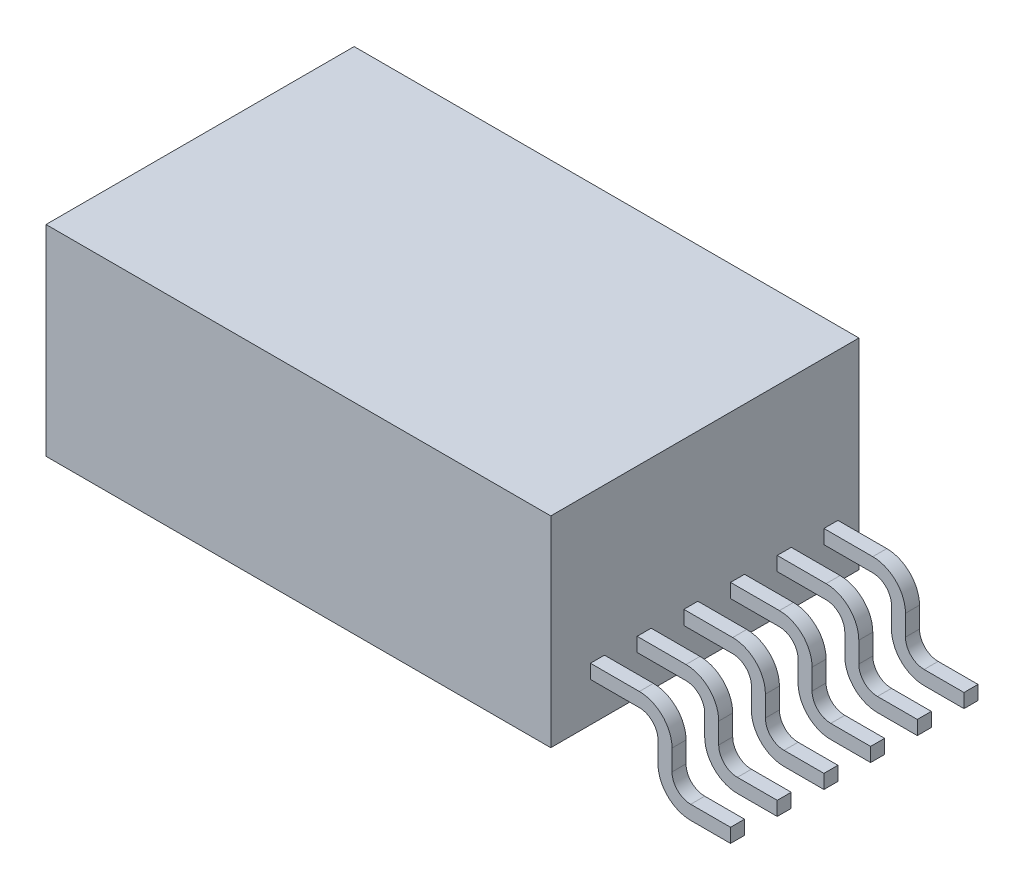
ISO-10303-21;
HEADER;
FILE_DESCRIPTION(('STEP AP214'),'2;1');
FILE_NAME('part.step','',(''),(''),'','','');
FILE_SCHEMA(('AUTOMOTIVE_DESIGN { 1 0 10303 214 1 1 1 1 }'));
ENDSEC;
DATA;
#1=APPLICATION_CONTEXT('core data for automotive mechanical design processes');
#2=APPLICATION_PROTOCOL_DEFINITION('international standard','automotive_design',2000,#1);
#3=PRODUCT_CONTEXT('',#1,'mechanical');
#4=PRODUCT('Part','Part','',(#3));
#5=PRODUCT_RELATED_PRODUCT_CATEGORY('part','',(#4));
#6=PRODUCT_DEFINITION_FORMATION('','',#4);
#7=PRODUCT_DEFINITION_CONTEXT('part definition',#1,'design');
#8=PRODUCT_DEFINITION('design','',#6,#7);
#9=PRODUCT_DEFINITION_SHAPE('','',#8);
#10=(LENGTH_UNIT() NAMED_UNIT(*) SI_UNIT(.MILLI.,.METRE.));
#11=(NAMED_UNIT(*) PLANE_ANGLE_UNIT() SI_UNIT($,.RADIAN.));
#12=(NAMED_UNIT(*) SI_UNIT($,.STERADIAN.) SOLID_ANGLE_UNIT());
#13=UNCERTAINTY_MEASURE_WITH_UNIT(LENGTH_MEASURE(1.E-05),#10,'distance_accuracy_value','');
#14=(GEOMETRIC_REPRESENTATION_CONTEXT(3) GLOBAL_UNCERTAINTY_ASSIGNED_CONTEXT((#13)) GLOBAL_UNIT_ASSIGNED_CONTEXT((#10,
#11,#12)) REPRESENTATION_CONTEXT('',''));
#15=CARTESIAN_POINT('',(0.,0.,0.));
#16=DIRECTION('',(0.,0.,1.));
#17=DIRECTION('',(1.,0.,0.));
#18=AXIS2_PLACEMENT_3D('',#15,#16,#17);
#19=CARTESIAN_POINT('',(0.,17.2889266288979,-3.));
#20=DIRECTION('',(1.,0.,0.));
#21=DIRECTION('',(0.,1.,0.));
#22=AXIS2_PLACEMENT_3D('',#19,#20,#21);
#23=PLANE('',#22);
#24=DIRECTION('',(0.,0.,-1.));
#25=VECTOR('',#24,1.);
#26=CARTESIAN_POINT('',(0.,0.,20.75));
#27=LINE('',#26,#25);
#28=CARTESIAN_POINT('',(0.,0.,20.75));
#29=VERTEX_POINT('',#28);
#30=CARTESIAN_POINT('',(0.,0.,19.25));
#31=VERTEX_POINT('',#30);
#32=EDGE_CURVE('E678',#29,#31,#27,.T.);
#33=ORIENTED_EDGE('',*,*,#32,.F.);
#34=DIRECTION('',(0.,-1.,0.));
#35=VECTOR('',#34,1.);
#36=CARTESIAN_POINT('',(0.,1.5,20.75));
#37=LINE('',#36,#35);
#38=CARTESIAN_POINT('',(0.,1.5,20.75));
#39=VERTEX_POINT('',#38);
#40=EDGE_CURVE('E596',#39,#29,#37,.T.);
#41=ORIENTED_EDGE('',*,*,#40,.F.);
#42=DIRECTION('',(0.,0.,-1.));
#43=VECTOR('',#42,1.);
#44=CARTESIAN_POINT('',(0.,1.5,20.75));
#45=LINE('',#44,#43);
#46=CARTESIAN_POINT('',(0.,1.5,19.25));
#47=VERTEX_POINT('',#46);
#48=EDGE_CURVE('E623',#39,#47,#45,.T.);
#49=ORIENTED_EDGE('',*,*,#48,.T.);
#50=DIRECTION('',(0.,-1.,0.));
#51=VECTOR('',#50,1.);
#52=CARTESIAN_POINT('',(0.,1.5,19.25));
#53=LINE('',#52,#51);
#54=EDGE_CURVE('E595',#47,#31,#53,.T.);
#55=ORIENTED_EDGE('',*,*,#54,.T.);
#56=EDGE_LOOP('',(#33,#41,#49,#55));
#57=FACE_BOUND('',#56,.T.);
#58=DIRECTION('',(0.,0.,-1.));
#59=VECTOR('',#58,1.);
#60=CARTESIAN_POINT('',(0.,0.,10.75));
#61=LINE('',#60,#59);
#62=CARTESIAN_POINT('',(0.,0.,10.75));
#63=VERTEX_POINT('',#62);
#64=CARTESIAN_POINT('',(0.,0.,9.25));
#65=VERTEX_POINT('',#64);
#66=EDGE_CURVE('E850',#63,#65,#61,.T.);
#67=ORIENTED_EDGE('',*,*,#66,.F.);
#68=DIRECTION('',(0.,-1.,0.));
#69=VECTOR('',#68,1.);
#70=CARTESIAN_POINT('',(0.,1.5,10.75));
#71=LINE('',#70,#69);
#72=CARTESIAN_POINT('',(0.,1.5,10.75));
#73=VERTEX_POINT('',#72);
#74=EDGE_CURVE('E768',#73,#63,#71,.T.);
#75=ORIENTED_EDGE('',*,*,#74,.F.);
#76=DIRECTION('',(0.,0.,-1.));
#77=VECTOR('',#76,1.);
#78=CARTESIAN_POINT('',(0.,1.5,10.75));
#79=LINE('',#78,#77);
#80=CARTESIAN_POINT('',(0.,1.5,9.25));
#81=VERTEX_POINT('',#80);
#82=EDGE_CURVE('E795',#73,#81,#79,.T.);
#83=ORIENTED_EDGE('',*,*,#82,.T.);
#84=DIRECTION('',(0.,-1.,0.));
#85=VECTOR('',#84,1.);
#86=CARTESIAN_POINT('',(0.,1.5,9.25));
#87=LINE('',#86,#85);
#88=EDGE_CURVE('E767',#81,#65,#87,.T.);
#89=ORIENTED_EDGE('',*,*,#88,.T.);
#90=EDGE_LOOP('',(#67,#75,#83,#89));
#91=FACE_BOUND('',#90,.T.);
#92=DIRECTION('',(0.,-1.,0.));
#93=VECTOR('',#92,1.);
#94=CARTESIAN_POINT('',(0.,1.5,0.75));
#95=LINE('',#94,#93);
#96=CARTESIAN_POINT('',(0.,1.5,0.75));
#97=VERTEX_POINT('',#96);
#98=CARTESIAN_POINT('',(0.,0.,0.75));
#99=VERTEX_POINT('',#98);
#100=EDGE_CURVE('E972',#97,#99,#95,.T.);
#101=ORIENTED_EDGE('',*,*,#100,.F.);
#102=DIRECTION('',(0.,0.,-1.));
#103=VECTOR('',#102,1.);
#104=CARTESIAN_POINT('',(0.,1.5,0.75));
#105=LINE('',#104,#103);
#106=CARTESIAN_POINT('',(0.,1.5,-0.75));
#107=VERTEX_POINT('',#106);
#108=EDGE_CURVE('E998',#97,#107,#105,.T.);
#109=ORIENTED_EDGE('',*,*,#108,.T.);
#110=DIRECTION('',(0.,-1.,0.));
#111=VECTOR('',#110,1.);
#112=CARTESIAN_POINT('',(0.,1.5,-0.75));
#113=LINE('',#112,#111);
#114=CARTESIAN_POINT('',(0.,0.,-0.75));
#115=VERTEX_POINT('',#114);
#116=EDGE_CURVE('E966',#107,#115,#113,.T.);
#117=ORIENTED_EDGE('',*,*,#116,.T.);
#118=DIRECTION('',(0.,0.,-1.));
#119=VECTOR('',#118,1.);
#120=CARTESIAN_POINT('',(0.,0.,0.75));
#121=LINE('',#120,#119);
#122=EDGE_CURVE('E11',#99,#115,#121,.T.);
#123=ORIENTED_EDGE('',*,*,#122,.F.);
#124=EDGE_LOOP('',(#101,#109,#117,#123));
#125=FACE_BOUND('',#124,.T.);
#126=DIRECTION('',(0.,0.,1.));
#127=VECTOR('',#126,1.);
#128=CARTESIAN_POINT('',(0.,17.2889266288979,-3.));
#129=LINE('',#128,#127);
#130=CARTESIAN_POINT('',(0.,17.2889266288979,-3.));
#131=VERTEX_POINT('',#130);
#132=CARTESIAN_POINT('',(0.,17.2889266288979,30.));
#133=VERTEX_POINT('',#132);
#134=EDGE_CURVE('E967',#131,#133,#129,.T.);
#135=ORIENTED_EDGE('',*,*,#134,.T.);
#136=DIRECTION('',(0.,1.,0.));
#137=VECTOR('',#136,1.);
#138=CARTESIAN_POINT('',(0.,17.2889266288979,30.));
#139=LINE('',#138,#137);
#140=CARTESIAN_POINT('',(0.,-4.2110733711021,30.));
#141=VERTEX_POINT('',#140);
#142=EDGE_CURVE('E945',#141,#133,#139,.T.);
#143=ORIENTED_EDGE('',*,*,#142,.F.);
#144=DIRECTION('',(0.,0.,1.));
#145=VECTOR('',#144,1.);
#146=CARTESIAN_POINT('',(0.,-4.2110733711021,-3.));
#147=LINE('',#146,#145);
#148=CARTESIAN_POINT('',(0.,-4.2110733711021,-3.));
#149=VERTEX_POINT('',#148);
#150=EDGE_CURVE('E969',#149,#141,#147,.T.);
#151=ORIENTED_EDGE('',*,*,#150,.F.);
#152=DIRECTION('',(0.,1.,0.));
#153=VECTOR('',#152,1.);
#154=CARTESIAN_POINT('',(0.,17.2889266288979,-3.));
#155=LINE('',#154,#153);
#156=EDGE_CURVE('E957',#149,#131,#155,.T.);
#157=ORIENTED_EDGE('',*,*,#156,.T.);
#158=EDGE_LOOP('',(#135,#143,#151,#157));
#159=FACE_BOUND('',#158,.T.);
#160=DIRECTION('',(0.,0.,-1.));
#161=VECTOR('',#160,1.);
#162=CARTESIAN_POINT('',(0.,0.,5.75));
#163=LINE('',#162,#161);
#164=CARTESIAN_POINT('',(0.,0.,5.75));
#165=VERTEX_POINT('',#164);
#166=CARTESIAN_POINT('',(0.,0.,4.25));
#167=VERTEX_POINT('',#166);
#168=EDGE_CURVE('E936',#165,#167,#163,.T.);
#169=ORIENTED_EDGE('',*,*,#168,.F.);
#170=DIRECTION('',(0.,-1.,0.));
#171=VECTOR('',#170,1.);
#172=CARTESIAN_POINT('',(0.,1.5,5.75));
#173=LINE('',#172,#171);
#174=CARTESIAN_POINT('',(0.,1.5,5.75));
#175=VERTEX_POINT('',#174);
#176=EDGE_CURVE('E854',#175,#165,#173,.T.);
#177=ORIENTED_EDGE('',*,*,#176,.F.);
#178=DIRECTION('',(0.,0.,-1.));
#179=VECTOR('',#178,1.);
#180=CARTESIAN_POINT('',(0.,1.5,5.75));
#181=LINE('',#180,#179);
#182=CARTESIAN_POINT('',(0.,1.5,4.25));
#183=VERTEX_POINT('',#182);
#184=EDGE_CURVE('E881',#175,#183,#181,.T.);
#185=ORIENTED_EDGE('',*,*,#184,.T.);
#186=DIRECTION('',(0.,-1.,0.));
#187=VECTOR('',#186,1.);
#188=CARTESIAN_POINT('',(0.,1.5,4.25));
#189=LINE('',#188,#187);
#190=EDGE_CURVE('E853',#183,#167,#189,.T.);
#191=ORIENTED_EDGE('',*,*,#190,.T.);
#192=EDGE_LOOP('',(#169,#177,#185,#191));
#193=FACE_BOUND('',#192,.T.);
#194=DIRECTION('',(0.,0.,-1.));
#195=VECTOR('',#194,1.);
#196=CARTESIAN_POINT('',(0.,0.,15.75));
#197=LINE('',#196,#195);
#198=CARTESIAN_POINT('',(0.,0.,15.75));
#199=VERTEX_POINT('',#198);
#200=CARTESIAN_POINT('',(0.,0.,14.25));
#201=VERTEX_POINT('',#200);
#202=EDGE_CURVE('E764',#199,#201,#197,.T.);
#203=ORIENTED_EDGE('',*,*,#202,.F.);
#204=DIRECTION('',(0.,-1.,0.));
#205=VECTOR('',#204,1.);
#206=CARTESIAN_POINT('',(0.,1.5,15.75));
#207=LINE('',#206,#205);
#208=CARTESIAN_POINT('',(0.,1.5,15.75));
#209=VERTEX_POINT('',#208);
#210=EDGE_CURVE('E682',#209,#199,#207,.T.);
#211=ORIENTED_EDGE('',*,*,#210,.F.);
#212=DIRECTION('',(0.,0.,-1.));
#213=VECTOR('',#212,1.);
#214=CARTESIAN_POINT('',(0.,1.5,15.75));
#215=LINE('',#214,#213);
#216=CARTESIAN_POINT('',(0.,1.5,14.25));
#217=VERTEX_POINT('',#216);
#218=EDGE_CURVE('E709',#209,#217,#215,.T.);
#219=ORIENTED_EDGE('',*,*,#218,.T.);
#220=DIRECTION('',(0.,-1.,0.));
#221=VECTOR('',#220,1.);
#222=CARTESIAN_POINT('',(0.,1.5,14.25));
#223=LINE('',#222,#221);
#224=EDGE_CURVE('E681',#217,#201,#223,.T.);
#225=ORIENTED_EDGE('',*,*,#224,.T.);
#226=EDGE_LOOP('',(#203,#211,#219,#225));
#227=FACE_BOUND('',#226,.T.);
#228=DIRECTION('',(0.,0.,-1.));
#229=VECTOR('',#228,1.);
#230=CARTESIAN_POINT('',(0.,0.,25.75));
#231=LINE('',#230,#229);
#232=CARTESIAN_POINT('',(0.,0.,25.75));
#233=VERTEX_POINT('',#232);
#234=CARTESIAN_POINT('',(0.,0.,24.25));
#235=VERTEX_POINT('',#234);
#236=EDGE_CURVE('E48',#233,#235,#231,.T.);
#237=ORIENTED_EDGE('',*,*,#236,.F.);
#238=DIRECTION('',(0.,-1.,0.));
#239=VECTOR('',#238,1.);
#240=CARTESIAN_POINT('',(0.,1.5,25.75));
#241=LINE('',#240,#239);
#242=CARTESIAN_POINT('',(0.,1.5,25.75));
#243=VERTEX_POINT('',#242);
#244=EDGE_CURVE('E53',#243,#233,#241,.T.);
#245=ORIENTED_EDGE('',*,*,#244,.F.);
#246=DIRECTION('',(0.,0.,-1.));
#247=VECTOR('',#246,1.);
#248=CARTESIAN_POINT('',(0.,1.5,25.75));
#249=LINE('',#248,#247);
#250=CARTESIAN_POINT('',(0.,1.5,24.25));
#251=VERTEX_POINT('',#250);
#252=EDGE_CURVE('E543',#243,#251,#249,.T.);
#253=ORIENTED_EDGE('',*,*,#252,.T.);
#254=DIRECTION('',(0.,-1.,0.));
#255=VECTOR('',#254,1.);
#256=CARTESIAN_POINT('',(0.,1.5,24.25));
#257=LINE('',#256,#255);
#258=EDGE_CURVE('E544',#251,#235,#257,.T.);
#259=ORIENTED_EDGE('',*,*,#258,.T.);
#260=EDGE_LOOP('',(#237,#245,#253,#259));
#261=FACE_BOUND('',#260,.T.);
#262=ADVANCED_FACE('F33',(#57,#91,#125,#159,#193,#227,#261),#23,.T.);
#263=CARTESIAN_POINT('',(0.,0.,0.75));
#264=DIRECTION('',(0.,1.,0.));
#265=DIRECTION('',(0.,0.,1.));
#266=AXIS2_PLACEMENT_3D('',#263,#264,#265);
#267=PLANE('',#266);
#268=DIRECTION('',(1.,0.,0.));
#269=VECTOR('',#268,1.);
#270=CARTESIAN_POINT('',(0.,0.,-0.75));
#271=LINE('',#270,#269);
#272=CARTESIAN_POINT('',(5.2332254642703,0.,-0.75));
#273=VERTEX_POINT('',#272);
#274=EDGE_CURVE('E1001',#115,#273,#271,.T.);
#275=ORIENTED_EDGE('',*,*,#274,.T.);
#276=DIRECTION('',(0.,0.,-1.));
#277=VECTOR('',#276,1.);
#278=CARTESIAN_POINT('',(5.2332254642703,0.,0.75));
#279=LINE('',#278,#277);
#280=CARTESIAN_POINT('',(5.2332254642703,0.,0.75));
#281=VERTEX_POINT('',#280);
#282=EDGE_CURVE('E41',#281,#273,#279,.T.);
#283=ORIENTED_EDGE('',*,*,#282,.F.);
#284=DIRECTION('',(1.,0.,0.));
#285=VECTOR('',#284,1.);
#286=CARTESIAN_POINT('',(0.,0.,0.75));
#287=LINE('',#286,#285);
#288=EDGE_CURVE('E975',#99,#281,#287,.T.);
#289=ORIENTED_EDGE('',*,*,#288,.F.);
#290=ORIENTED_EDGE('',*,*,#122,.T.);
#291=EDGE_LOOP('',(#275,#283,#289,#290));
#292=FACE_BOUND('',#291,.T.);
#293=ADVANCED_FACE('F35',(#292),#267,.F.);
#294=CARTESIAN_POINT('',(5.2332254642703,-2.,0.75));
#295=DIRECTION('',(0.,0.,-1.));
#296=DIRECTION('',(-1.,0.,0.));
#297=AXIS2_PLACEMENT_3D('',#294,#295,#296);
#298=CYLINDRICAL_SURFACE('',#297,2.);
#299=CARTESIAN_POINT('',(5.2332254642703,-2.,-0.75));
#300=DIRECTION('',(0.,0.,-1.));
#301=DIRECTION('',(-1.,0.,0.));
#302=AXIS2_PLACEMENT_3D('',#299,#300,#301);
#303=CIRCLE('',#302,2.);
#304=CARTESIAN_POINT('',(7.2332254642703,-2.,-0.75));
#305=VERTEX_POINT('',#304);
#306=EDGE_CURVE('E1003',#273,#305,#303,.T.);
#307=ORIENTED_EDGE('',*,*,#306,.T.);
#308=DIRECTION('',(0.,0.,-1.));
#309=VECTOR('',#308,1.);
#310=CARTESIAN_POINT('',(7.2332254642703,-2.,0.75));
#311=LINE('',#310,#309);
#312=CARTESIAN_POINT('',(7.2332254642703,-2.,0.75));
#313=VERTEX_POINT('',#312);
#314=EDGE_CURVE('E1048',#313,#305,#311,.T.);
#315=ORIENTED_EDGE('',*,*,#314,.F.);
#316=CARTESIAN_POINT('',(5.2332254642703,-2.,0.75));
#317=DIRECTION('',(0.,0.,-1.));
#318=DIRECTION('',(-1.,0.,0.));
#319=AXIS2_PLACEMENT_3D('',#316,#317,#318);
#320=CIRCLE('',#319,2.);
#321=EDGE_CURVE('E978',#281,#313,#320,.T.);
#322=ORIENTED_EDGE('',*,*,#321,.F.);
#323=ORIENTED_EDGE('',*,*,#282,.T.);
#324=EDGE_LOOP('',(#307,#315,#322,#323));
#325=FACE_BOUND('',#324,.T.);
#326=ADVANCED_FACE('F1055',(#325),#298,.F.);
#327=CARTESIAN_POINT('',(7.2332254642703,-2.,0.75));
#328=DIRECTION('',(1.,0.,0.));
#329=DIRECTION('',(0.,0.,-1.));
#330=AXIS2_PLACEMENT_3D('',#327,#328,#329);
#331=PLANE('',#330);
#332=DIRECTION('',(0.,-1.,0.));
#333=VECTOR('',#332,1.);
#334=CARTESIAN_POINT('',(7.2332254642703,-2.,-0.75));
#335=LINE('',#334,#333);
#336=CARTESIAN_POINT('',(7.2332254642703,-4.21107337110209,-0.75));
#337=VERTEX_POINT('',#336);
#338=EDGE_CURVE('E1005',#305,#337,#335,.T.);
#339=ORIENTED_EDGE('',*,*,#338,.T.);
#340=DIRECTION('',(0.,0.,-1.));
#341=VECTOR('',#340,1.);
#342=CARTESIAN_POINT('',(7.2332254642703,-4.21107337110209,0.75));
#343=LINE('',#342,#341);
#344=CARTESIAN_POINT('',(7.2332254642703,-4.21107337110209,0.75));
#345=VERTEX_POINT('',#344);
#346=EDGE_CURVE('E1045',#345,#337,#343,.T.);
#347=ORIENTED_EDGE('',*,*,#346,.F.);
#348=DIRECTION('',(0.,-1.,0.));
#349=VECTOR('',#348,1.);
#350=CARTESIAN_POINT('',(7.2332254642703,-2.,0.75));
#351=LINE('',#350,#349);
#352=EDGE_CURVE('E980',#313,#345,#351,.T.);
#353=ORIENTED_EDGE('',*,*,#352,.F.);
#354=ORIENTED_EDGE('',*,*,#314,.T.);
#355=EDGE_LOOP('',(#339,#347,#353,#354));
#356=FACE_BOUND('',#355,.T.);
#357=ADVANCED_FACE('F1067',(#356),#331,.F.);
#358=CARTESIAN_POINT('',(10.7332254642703,-4.21107337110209,0.75));
#359=DIRECTION('',(0.,0.,-1.));
#360=DIRECTION('',(-1.,0.,0.));
#361=AXIS2_PLACEMENT_3D('',#358,#359,#360);
#362=CYLINDRICAL_SURFACE('',#361,3.5);
#363=CARTESIAN_POINT('',(10.7332254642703,-4.21107337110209,-0.75));
#364=DIRECTION('',(0.,0.,1.));
#365=DIRECTION('',(1.,0.,0.));
#366=AXIS2_PLACEMENT_3D('',#363,#364,#365);
#367=CIRCLE('',#366,3.5);
#368=CARTESIAN_POINT('',(10.7332254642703,-7.71107337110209,-0.75));
#369=VERTEX_POINT('',#368);
#370=EDGE_CURVE('E1007',#337,#369,#367,.T.);
#371=ORIENTED_EDGE('',*,*,#370,.T.);
#372=DIRECTION('',(0.,0.,-1.));
#373=VECTOR('',#372,1.);
#374=CARTESIAN_POINT('',(10.7332254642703,-7.71107337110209,0.75));
#375=LINE('',#374,#373);
#376=CARTESIAN_POINT('',(10.7332254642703,-7.71107337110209,0.75));
#377=VERTEX_POINT('',#376);
#378=EDGE_CURVE('E1042',#377,#369,#375,.T.);
#379=ORIENTED_EDGE('',*,*,#378,.F.);
#380=CARTESIAN_POINT('',(10.7332254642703,-4.21107337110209,0.75));
#381=DIRECTION('',(0.,0.,1.));
#382=DIRECTION('',(1.,0.,0.));
#383=AXIS2_PLACEMENT_3D('',#380,#381,#382);
#384=CIRCLE('',#383,3.5);
#385=EDGE_CURVE('E982',#345,#377,#384,.T.);
#386=ORIENTED_EDGE('',*,*,#385,.F.);
#387=ORIENTED_EDGE('',*,*,#346,.T.);
#388=EDGE_LOOP('',(#371,#379,#386,#387));
#389=FACE_BOUND('',#388,.T.);
#390=ADVANCED_FACE('F1071',(#389),#362,.T.);
#391=CARTESIAN_POINT('',(10.7332254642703,-7.7110733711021,0.75));
#392=DIRECTION('',(0.,1.,0.));
#393=DIRECTION('',(-1.,0.,0.));
#394=AXIS2_PLACEMENT_3D('',#391,#392,#393);
#395=PLANE('',#394);
#396=DIRECTION('',(1.,0.,0.));
#397=VECTOR('',#396,1.);
#398=CARTESIAN_POINT('',(10.7332254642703,-7.7110733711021,-0.75));
#399=LINE('',#398,#397);
#400=CARTESIAN_POINT('',(15.,-7.71107337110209,-0.75));
#401=VERTEX_POINT('',#400);
#402=EDGE_CURVE('E1009',#369,#401,#399,.T.);
#403=ORIENTED_EDGE('',*,*,#402,.T.);
#404=DIRECTION('',(0.,0.,-1.));
#405=VECTOR('',#404,1.);
#406=CARTESIAN_POINT('',(15.,-7.71107337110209,0.75));
#407=LINE('',#406,#405);
#408=CARTESIAN_POINT('',(15.,-7.71107337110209,0.75));
#409=VERTEX_POINT('',#408);
#410=EDGE_CURVE('E1039',#409,#401,#407,.T.);
#411=ORIENTED_EDGE('',*,*,#410,.F.);
#412=DIRECTION('',(1.,0.,0.));
#413=VECTOR('',#412,1.);
#414=CARTESIAN_POINT('',(10.7332254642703,-7.7110733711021,0.75));
#415=LINE('',#414,#413);
#416=EDGE_CURVE('E984',#377,#409,#415,.T.);
#417=ORIENTED_EDGE('',*,*,#416,.F.);
#418=ORIENTED_EDGE('',*,*,#378,.T.);
#419=EDGE_LOOP('',(#403,#411,#417,#418));
#420=FACE_BOUND('',#419,.T.);
#421=ADVANCED_FACE('F1112',(#420),#395,.F.);
#422=CARTESIAN_POINT('',(15.,-6.21107337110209,0.75));
#423=DIRECTION('',(-1.,0.,0.));
#424=DIRECTION('',(0.,0.,1.));
#425=AXIS2_PLACEMENT_3D('',#422,#423,#424);
#426=PLANE('',#425);
#427=DIRECTION('',(0.,1.,0.));
#428=VECTOR('',#427,1.);
#429=CARTESIAN_POINT('',(15.,-6.21107337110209,-0.75));
#430=LINE('',#429,#428);
#431=CARTESIAN_POINT('',(15.,-6.21107337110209,-0.75));
#432=VERTEX_POINT('',#431);
#433=EDGE_CURVE('E1011',#401,#432,#430,.T.);
#434=ORIENTED_EDGE('',*,*,#433,.T.);
#435=DIRECTION('',(0.,0.,-1.));
#436=VECTOR('',#435,1.);
#437=CARTESIAN_POINT('',(15.,-6.21107337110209,0.75));
#438=LINE('',#437,#436);
#439=CARTESIAN_POINT('',(15.,-6.21107337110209,0.75));
#440=VERTEX_POINT('',#439);
#441=EDGE_CURVE('E1036',#440,#432,#438,.T.);
#442=ORIENTED_EDGE('',*,*,#441,.F.);
#443=DIRECTION('',(0.,1.,0.));
#444=VECTOR('',#443,1.);
#445=CARTESIAN_POINT('',(15.,-6.21107337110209,0.75));
#446=LINE('',#445,#444);
#447=EDGE_CURVE('E986',#409,#440,#446,.T.);
#448=ORIENTED_EDGE('',*,*,#447,.F.);
#449=ORIENTED_EDGE('',*,*,#410,.T.);
#450=EDGE_LOOP('',(#434,#442,#448,#449));
#451=FACE_BOUND('',#450,.T.);
#452=ADVANCED_FACE('F1110',(#451),#426,.F.);
#453=CARTESIAN_POINT('',(10.7332254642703,-6.21107337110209,0.75));
#454=DIRECTION('',(0.,-1.,0.));
#455=DIRECTION('',(0.,0.,-1.));
#456=AXIS2_PLACEMENT_3D('',#453,#454,#455);
#457=PLANE('',#456);
#458=DIRECTION('',(-1.,0.,0.));
#459=VECTOR('',#458,1.);
#460=CARTESIAN_POINT('',(10.7332254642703,-6.21107337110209,-0.75));
#461=LINE('',#460,#459);
#462=CARTESIAN_POINT('',(10.7332254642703,-6.21107337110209,-0.75));
#463=VERTEX_POINT('',#462);
#464=EDGE_CURVE('E1013',#432,#463,#461,.T.);
#465=ORIENTED_EDGE('',*,*,#464,.T.);
#466=DIRECTION('',(0.,0.,-1.));
#467=VECTOR('',#466,1.);
#468=CARTESIAN_POINT('',(10.7332254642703,-6.21107337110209,0.75));
#469=LINE('',#468,#467);
#470=CARTESIAN_POINT('',(10.7332254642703,-6.21107337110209,0.75));
#471=VERTEX_POINT('',#470);
#472=EDGE_CURVE('E1033',#471,#463,#469,.T.);
#473=ORIENTED_EDGE('',*,*,#472,.F.);
#474=DIRECTION('',(-1.,0.,0.));
#475=VECTOR('',#474,1.);
#476=CARTESIAN_POINT('',(10.7332254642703,-6.21107337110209,0.75));
#477=LINE('',#476,#475);
#478=EDGE_CURVE('E988',#440,#471,#477,.T.);
#479=ORIENTED_EDGE('',*,*,#478,.F.);
#480=ORIENTED_EDGE('',*,*,#441,.T.);
#481=EDGE_LOOP('',(#465,#473,#479,#480));
#482=FACE_BOUND('',#481,.T.);
#483=ADVANCED_FACE('F1106',(#482),#457,.F.);
#484=CARTESIAN_POINT('',(10.7332254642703,-4.21107337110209,0.75));
#485=DIRECTION('',(0.,0.,-1.));
#486=DIRECTION('',(-1.,0.,0.));
#487=AXIS2_PLACEMENT_3D('',#484,#485,#486);
#488=CYLINDRICAL_SURFACE('',#487,2.);
#489=CARTESIAN_POINT('',(10.7332254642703,-4.21107337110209,-0.75));
#490=DIRECTION('',(0.,0.,-1.));
#491=DIRECTION('',(1.,0.,0.));
#492=AXIS2_PLACEMENT_3D('',#489,#490,#491);
#493=CIRCLE('',#492,2.);
#494=CARTESIAN_POINT('',(8.7332254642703,-4.21107337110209,-0.75));
#495=VERTEX_POINT('',#494);
#496=EDGE_CURVE('E1015',#463,#495,#493,.T.);
#497=ORIENTED_EDGE('',*,*,#496,.T.);
#498=DIRECTION('',(0.,0.,-1.));
#499=VECTOR('',#498,1.);
#500=CARTESIAN_POINT('',(8.7332254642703,-4.21107337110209,0.75));
#501=LINE('',#500,#499);
#502=CARTESIAN_POINT('',(8.7332254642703,-4.21107337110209,0.75));
#503=VERTEX_POINT('',#502);
#504=EDGE_CURVE('E1030',#503,#495,#501,.T.);
#505=ORIENTED_EDGE('',*,*,#504,.F.);
#506=CARTESIAN_POINT('',(10.7332254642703,-4.21107337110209,0.75));
#507=DIRECTION('',(0.,0.,-1.));
#508=DIRECTION('',(1.,0.,0.));
#509=AXIS2_PLACEMENT_3D('',#506,#507,#508);
#510=CIRCLE('',#509,2.);
#511=EDGE_CURVE('E990',#471,#503,#510,.T.);
#512=ORIENTED_EDGE('',*,*,#511,.F.);
#513=ORIENTED_EDGE('',*,*,#472,.T.);
#514=EDGE_LOOP('',(#497,#505,#512,#513));
#515=FACE_BOUND('',#514,.T.);
#516=ADVANCED_FACE('F1101',(#515),#488,.F.);
#517=CARTESIAN_POINT('',(8.7332254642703,-2.,0.75));
#518=DIRECTION('',(-1.,0.,0.));
#519=DIRECTION('',(0.,0.,1.));
#520=AXIS2_PLACEMENT_3D('',#517,#518,#519);
#521=PLANE('',#520);
#522=DIRECTION('',(0.,1.,0.));
#523=VECTOR('',#522,1.);
#524=CARTESIAN_POINT('',(8.7332254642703,-2.,-0.75));
#525=LINE('',#524,#523);
#526=CARTESIAN_POINT('',(8.7332254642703,-2.,-0.75));
#527=VERTEX_POINT('',#526);
#528=EDGE_CURVE('E1017',#495,#527,#525,.T.);
#529=ORIENTED_EDGE('',*,*,#528,.T.);
#530=DIRECTION('',(0.,0.,-1.));
#531=VECTOR('',#530,1.);
#532=CARTESIAN_POINT('',(8.7332254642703,-2.,0.75));
#533=LINE('',#532,#531);
#534=CARTESIAN_POINT('',(8.7332254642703,-2.,0.75));
#535=VERTEX_POINT('',#534);
#536=EDGE_CURVE('E1027',#535,#527,#533,.T.);
#537=ORIENTED_EDGE('',*,*,#536,.F.);
#538=DIRECTION('',(0.,1.,0.));
#539=VECTOR('',#538,1.);
#540=CARTESIAN_POINT('',(8.7332254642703,-2.,0.75));
#541=LINE('',#540,#539);
#542=EDGE_CURVE('E992',#503,#535,#541,.T.);
#543=ORIENTED_EDGE('',*,*,#542,.F.);
#544=ORIENTED_EDGE('',*,*,#504,.T.);
#545=EDGE_LOOP('',(#529,#537,#543,#544));
#546=FACE_BOUND('',#545,.T.);
#547=ADVANCED_FACE('F1095',(#546),#521,.F.);
#548=CARTESIAN_POINT('',(5.2332254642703,-2.,0.75));
#549=DIRECTION('',(0.,0.,-1.));
#550=DIRECTION('',(-1.,0.,0.));
#551=AXIS2_PLACEMENT_3D('',#548,#549,#550);
#552=CYLINDRICAL_SURFACE('',#551,3.5);
#553=CARTESIAN_POINT('',(5.2332254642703,-2.,-0.75));
#554=DIRECTION('',(0.,0.,1.));
#555=DIRECTION('',(-1.,0.,0.));
#556=AXIS2_PLACEMENT_3D('',#553,#554,#555);
#557=CIRCLE('',#556,3.5);
#558=CARTESIAN_POINT('',(5.2332254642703,1.5,-0.75));
#559=VERTEX_POINT('',#558);
#560=EDGE_CURVE('E1019',#527,#559,#557,.T.);
#561=ORIENTED_EDGE('',*,*,#560,.T.);
#562=DIRECTION('',(0.,0.,-1.));
#563=VECTOR('',#562,1.);
#564=CARTESIAN_POINT('',(5.2332254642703,1.5,0.75));
#565=LINE('',#564,#563);
#566=CARTESIAN_POINT('',(5.2332254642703,1.5,0.75));
#567=VERTEX_POINT('',#566);
#568=EDGE_CURVE('E1024',#567,#559,#565,.T.);
#569=ORIENTED_EDGE('',*,*,#568,.F.);
#570=CARTESIAN_POINT('',(5.2332254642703,-2.,0.75));
#571=DIRECTION('',(0.,0.,1.));
#572=DIRECTION('',(-1.,0.,0.));
#573=AXIS2_PLACEMENT_3D('',#570,#571,#572);
#574=CIRCLE('',#573,3.5);
#575=EDGE_CURVE('E994',#535,#567,#574,.T.);
#576=ORIENTED_EDGE('',*,*,#575,.F.);
#577=ORIENTED_EDGE('',*,*,#536,.T.);
#578=EDGE_LOOP('',(#561,#569,#576,#577));
#579=FACE_BOUND('',#578,.T.);
#580=ADVANCED_FACE('F1091',(#579),#552,.T.);
#581=CARTESIAN_POINT('',(0.,1.5,0.75));
#582=DIRECTION('',(0.,-1.,0.));
#583=DIRECTION('',(0.,0.,-1.));
#584=AXIS2_PLACEMENT_3D('',#581,#582,#583);
#585=PLANE('',#584);
#586=DIRECTION('',(-1.,0.,0.));
#587=VECTOR('',#586,1.);
#588=CARTESIAN_POINT('',(0.,1.5,-0.75));
#589=LINE('',#588,#587);
#590=EDGE_CURVE('E976',#559,#107,#589,.T.);
#591=ORIENTED_EDGE('',*,*,#590,.T.);
#592=ORIENTED_EDGE('',*,*,#108,.F.);
#593=DIRECTION('',(-1.,0.,0.));
#594=VECTOR('',#593,1.);
#595=CARTESIAN_POINT('',(0.,1.5,0.75));
#596=LINE('',#595,#594);
#597=EDGE_CURVE('E996',#567,#97,#596,.T.);
#598=ORIENTED_EDGE('',*,*,#597,.F.);
#599=ORIENTED_EDGE('',*,*,#568,.T.);
#600=EDGE_LOOP('',(#591,#592,#598,#599));
#601=FACE_BOUND('',#600,.T.);
#602=ADVANCED_FACE('F1086',(#601),#585,.F.);
#603=CARTESIAN_POINT('',(5.2332254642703,-2.,0.75));
#604=DIRECTION('',(0.,0.,-1.));
#605=DIRECTION('',(-1.,0.,0.));
#606=AXIS2_PLACEMENT_3D('',#603,#604,#605);
#607=PLANE('',#606);
#608=ORIENTED_EDGE('',*,*,#100,.T.);
#609=ORIENTED_EDGE('',*,*,#288,.T.);
#610=ORIENTED_EDGE('',*,*,#321,.T.);
#611=ORIENTED_EDGE('',*,*,#352,.T.);
#612=ORIENTED_EDGE('',*,*,#385,.T.);
#613=ORIENTED_EDGE('',*,*,#416,.T.);
#614=ORIENTED_EDGE('',*,*,#447,.T.);
#615=ORIENTED_EDGE('',*,*,#478,.T.);
#616=ORIENTED_EDGE('',*,*,#511,.T.);
#617=ORIENTED_EDGE('',*,*,#542,.T.);
#618=ORIENTED_EDGE('',*,*,#575,.T.);
#619=ORIENTED_EDGE('',*,*,#597,.T.);
#620=EDGE_LOOP('',(#608,#609,#610,#611,#612,#613,#614,#615,#616,#617,#618,#619));
#621=FACE_BOUND('',#620,.T.);
#622=ADVANCED_FACE('F1075',(#621),#607,.F.);
#623=CARTESIAN_POINT('',(5.2332254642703,-2.,-0.75));
#624=DIRECTION('',(0.,0.,-1.));
#625=DIRECTION('',(-1.,0.,0.));
#626=AXIS2_PLACEMENT_3D('',#623,#624,#625);
#627=PLANE('',#626);
#628=ORIENTED_EDGE('',*,*,#116,.F.);
#629=ORIENTED_EDGE('',*,*,#590,.F.);
#630=ORIENTED_EDGE('',*,*,#560,.F.);
#631=ORIENTED_EDGE('',*,*,#528,.F.);
#632=ORIENTED_EDGE('',*,*,#496,.F.);
#633=ORIENTED_EDGE('',*,*,#464,.F.);
#634=ORIENTED_EDGE('',*,*,#433,.F.);
#635=ORIENTED_EDGE('',*,*,#402,.F.);
#636=ORIENTED_EDGE('',*,*,#370,.F.);
#637=ORIENTED_EDGE('',*,*,#338,.F.);
#638=ORIENTED_EDGE('',*,*,#306,.F.);
#639=ORIENTED_EDGE('',*,*,#274,.F.);
#640=EDGE_LOOP('',(#628,#629,#630,#631,#632,#633,#634,#635,#636,#637,#638,#639));
#641=FACE_BOUND('',#640,.T.);
#642=ADVANCED_FACE('F1062',(#641),#627,.T.);
#643=CARTESIAN_POINT('',(-54.0524989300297,17.2889266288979,-3.));
#644=DIRECTION('',(-1.,0.,0.));
#645=DIRECTION('',(0.,0.,1.));
#646=AXIS2_PLACEMENT_3D('',#643,#644,#645);
#647=PLANE('',#646);
#648=DIRECTION('',(0.,0.,1.));
#649=VECTOR('',#648,1.);
#650=CARTESIAN_POINT('',(-54.0524989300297,-4.2110733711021,-3.));
#651=LINE('',#650,#649);
#652=CARTESIAN_POINT('',(-54.0524989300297,-4.2110733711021,-3.));
#653=VERTEX_POINT('',#652);
#654=CARTESIAN_POINT('',(-54.0524989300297,-4.2110733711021,30.));
#655=VERTEX_POINT('',#654);
#656=EDGE_CURVE('E963',#653,#655,#651,.T.);
#657=ORIENTED_EDGE('',*,*,#656,.T.);
#658=DIRECTION('',(0.,-1.,0.));
#659=VECTOR('',#658,1.);
#660=CARTESIAN_POINT('',(-54.0524989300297,17.2889266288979,30.));
#661=LINE('',#660,#659);
#662=CARTESIAN_POINT('',(-54.0524989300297,17.2889266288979,30.));
#663=VERTEX_POINT('',#662);
#664=EDGE_CURVE('E939',#663,#655,#661,.T.);
#665=ORIENTED_EDGE('',*,*,#664,.F.);
#666=DIRECTION('',(0.,0.,1.));
#667=VECTOR('',#666,1.);
#668=CARTESIAN_POINT('',(-54.0524989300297,17.2889266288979,-3.));
#669=LINE('',#668,#667);
#670=CARTESIAN_POINT('',(-54.0524989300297,17.2889266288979,-3.));
#671=VERTEX_POINT('',#670);
#672=EDGE_CURVE('E964',#671,#663,#669,.T.);
#673=ORIENTED_EDGE('',*,*,#672,.F.);
#674=DIRECTION('',(0.,-1.,0.));
#675=VECTOR('',#674,1.);
#676=CARTESIAN_POINT('',(-54.0524989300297,17.2889266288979,-3.));
#677=LINE('',#676,#675);
#678=EDGE_CURVE('E951',#671,#653,#677,.T.);
#679=ORIENTED_EDGE('',*,*,#678,.T.);
#680=EDGE_LOOP('',(#657,#665,#673,#679));
#681=FACE_BOUND('',#680,.T.);
#682=ADVANCED_FACE('F1137',(#681),#647,.T.);
#683=CARTESIAN_POINT('',(-54.0524989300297,17.2889266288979,-3.));
#684=DIRECTION('',(0.,1.,0.));
#685=DIRECTION('',(0.,0.,1.));
#686=AXIS2_PLACEMENT_3D('',#683,#684,#685);
#687=PLANE('',#686);
#688=ORIENTED_EDGE('',*,*,#672,.T.);
#689=DIRECTION('',(-1.,0.,0.));
#690=VECTOR('',#689,1.);
#691=CARTESIAN_POINT('',(-54.0524989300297,17.2889266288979,30.));
#692=LINE('',#691,#690);
#693=EDGE_CURVE('E948',#133,#663,#692,.T.);
#694=ORIENTED_EDGE('',*,*,#693,.F.);
#695=ORIENTED_EDGE('',*,*,#134,.F.);
#696=DIRECTION('',(-1.,0.,0.));
#697=VECTOR('',#696,1.);
#698=CARTESIAN_POINT('',(-54.0524989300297,17.2889266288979,-3.));
#699=LINE('',#698,#697);
#700=EDGE_CURVE('E960',#131,#671,#699,.T.);
#701=ORIENTED_EDGE('',*,*,#700,.T.);
#702=EDGE_LOOP('',(#688,#694,#695,#701));
#703=FACE_BOUND('',#702,.T.);
#704=ADVANCED_FACE('F1130',(#703),#687,.T.);
#705=CARTESIAN_POINT('',(-54.0524989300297,-4.2110733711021,-3.));
#706=DIRECTION('',(0.,-1.,0.));
#707=DIRECTION('',(0.,0.,-1.));
#708=AXIS2_PLACEMENT_3D('',#705,#706,#707);
#709=PLANE('',#708);
#710=ORIENTED_EDGE('',*,*,#150,.T.);
#711=DIRECTION('',(1.,0.,0.));
#712=VECTOR('',#711,1.);
#713=CARTESIAN_POINT('',(-54.0524989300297,-4.2110733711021,30.));
#714=LINE('',#713,#712);
#715=EDGE_CURVE('E942',#655,#141,#714,.T.);
#716=ORIENTED_EDGE('',*,*,#715,.F.);
#717=ORIENTED_EDGE('',*,*,#656,.F.);
#718=DIRECTION('',(1.,0.,0.));
#719=VECTOR('',#718,1.);
#720=CARTESIAN_POINT('',(-54.0524989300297,-4.2110733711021,-3.));
#721=LINE('',#720,#719);
#722=EDGE_CURVE('E954',#653,#149,#721,.T.);
#723=ORIENTED_EDGE('',*,*,#722,.T.);
#724=EDGE_LOOP('',(#710,#716,#717,#723));
#725=FACE_BOUND('',#724,.T.);
#726=ADVANCED_FACE('F1132',(#725),#709,.T.);
#727=CARTESIAN_POINT('',(-54.0524989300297,-4.2110733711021,-3.));
#728=DIRECTION('',(0.,0.,1.));
#729=DIRECTION('',(1.,0.,0.));
#730=AXIS2_PLACEMENT_3D('',#727,#728,#729);
#731=PLANE('',#730);
#732=ORIENTED_EDGE('',*,*,#678,.F.);
#733=ORIENTED_EDGE('',*,*,#700,.F.);
#734=ORIENTED_EDGE('',*,*,#156,.F.);
#735=ORIENTED_EDGE('',*,*,#722,.F.);
#736=EDGE_LOOP('',(#732,#733,#734,#735));
#737=FACE_BOUND('',#736,.T.);
#738=ADVANCED_FACE('F1135',(#737),#731,.F.);
#739=CARTESIAN_POINT('',(-54.0524989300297,-4.2110733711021,30.));
#740=DIRECTION('',(0.,0.,1.));
#741=DIRECTION('',(1.,0.,0.));
#742=AXIS2_PLACEMENT_3D('',#739,#740,#741);
#743=PLANE('',#742);
#744=ORIENTED_EDGE('',*,*,#664,.T.);
#745=ORIENTED_EDGE('',*,*,#715,.T.);
#746=ORIENTED_EDGE('',*,*,#142,.T.);
#747=ORIENTED_EDGE('',*,*,#693,.T.);
#748=EDGE_LOOP('',(#744,#745,#746,#747));
#749=FACE_BOUND('',#748,.T.);
#750=ADVANCED_FACE('F1203',(#749),#743,.T.);
#751=CARTESIAN_POINT('',(0.,0.,5.75));
#752=DIRECTION('',(0.,1.,0.));
#753=DIRECTION('',(0.,0.,1.));
#754=AXIS2_PLACEMENT_3D('',#751,#752,#753);
#755=PLANE('',#754);
#756=DIRECTION('',(1.,0.,0.));
#757=VECTOR('',#756,1.);
#758=CARTESIAN_POINT('',(0.,0.,4.25));
#759=LINE('',#758,#757);
#760=CARTESIAN_POINT('',(5.2332254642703,0.,4.25));
#761=VERTEX_POINT('',#760);
#762=EDGE_CURVE('E883',#167,#761,#759,.T.);
#763=ORIENTED_EDGE('',*,*,#762,.T.);
#764=DIRECTION('',(0.,0.,-1.));
#765=VECTOR('',#764,1.);
#766=CARTESIAN_POINT('',(5.2332254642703,0.,5.75));
#767=LINE('',#766,#765);
#768=CARTESIAN_POINT('',(5.2332254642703,0.,5.75));
#769=VERTEX_POINT('',#768);
#770=EDGE_CURVE('E933',#769,#761,#767,.T.);
#771=ORIENTED_EDGE('',*,*,#770,.F.);
#772=DIRECTION('',(1.,0.,0.));
#773=VECTOR('',#772,1.);
#774=CARTESIAN_POINT('',(0.,0.,5.75));
#775=LINE('',#774,#773);
#776=EDGE_CURVE('E857',#165,#769,#775,.T.);
#777=ORIENTED_EDGE('',*,*,#776,.F.);
#778=ORIENTED_EDGE('',*,*,#168,.T.);
#779=EDGE_LOOP('',(#763,#771,#777,#778));
#780=FACE_BOUND('',#779,.T.);
#781=ADVANCED_FACE('F1210',(#780),#755,.F.);
#782=CARTESIAN_POINT('',(5.2332254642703,-2.,5.75));
#783=DIRECTION('',(0.,0.,-1.));
#784=DIRECTION('',(-1.,0.,0.));
#785=AXIS2_PLACEMENT_3D('',#782,#783,#784);
#786=CYLINDRICAL_SURFACE('',#785,2.);
#787=CARTESIAN_POINT('',(5.2332254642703,-2.,4.25));
#788=DIRECTION('',(0.,0.,-1.));
#789=DIRECTION('',(-1.,0.,0.));
#790=AXIS2_PLACEMENT_3D('',#787,#788,#789);
#791=CIRCLE('',#790,2.);
#792=CARTESIAN_POINT('',(7.2332254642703,-2.,4.25));
#793=VERTEX_POINT('',#792);
#794=EDGE_CURVE('E885',#761,#793,#791,.T.);
#795=ORIENTED_EDGE('',*,*,#794,.T.);
#796=DIRECTION('',(0.,0.,-1.));
#797=VECTOR('',#796,1.);
#798=CARTESIAN_POINT('',(7.2332254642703,-2.,5.75));
#799=LINE('',#798,#797);
#800=CARTESIAN_POINT('',(7.2332254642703,-2.,5.75));
#801=VERTEX_POINT('',#800);
#802=EDGE_CURVE('E930',#801,#793,#799,.T.);
#803=ORIENTED_EDGE('',*,*,#802,.F.);
#804=CARTESIAN_POINT('',(5.2332254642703,-2.,5.75));
#805=DIRECTION('',(0.,0.,-1.));
#806=DIRECTION('',(-1.,0.,0.));
#807=AXIS2_PLACEMENT_3D('',#804,#805,#806);
#808=CIRCLE('',#807,2.);
#809=EDGE_CURVE('E860',#769,#801,#808,.T.);
#810=ORIENTED_EDGE('',*,*,#809,.F.);
#811=ORIENTED_EDGE('',*,*,#770,.T.);
#812=EDGE_LOOP('',(#795,#803,#810,#811));
#813=FACE_BOUND('',#812,.T.);
#814=ADVANCED_FACE('F1218',(#813),#786,.F.);
#815=CARTESIAN_POINT('',(7.2332254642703,-2.,5.75));
#816=DIRECTION('',(1.,0.,0.));
#817=DIRECTION('',(0.,0.,-1.));
#818=AXIS2_PLACEMENT_3D('',#815,#816,#817);
#819=PLANE('',#818);
#820=DIRECTION('',(0.,-1.,0.));
#821=VECTOR('',#820,1.);
#822=CARTESIAN_POINT('',(7.2332254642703,-2.,4.25));
#823=LINE('',#822,#821);
#824=CARTESIAN_POINT('',(7.2332254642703,-4.21107337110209,4.25));
#825=VERTEX_POINT('',#824);
#826=EDGE_CURVE('E887',#793,#825,#823,.T.);
#827=ORIENTED_EDGE('',*,*,#826,.T.);
#828=DIRECTION('',(0.,0.,-1.));
#829=VECTOR('',#828,1.);
#830=CARTESIAN_POINT('',(7.2332254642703,-4.21107337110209,5.75));
#831=LINE('',#830,#829);
#832=CARTESIAN_POINT('',(7.2332254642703,-4.21107337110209,5.75));
#833=VERTEX_POINT('',#832);
#834=EDGE_CURVE('E927',#833,#825,#831,.T.);
#835=ORIENTED_EDGE('',*,*,#834,.F.);
#836=DIRECTION('',(0.,-1.,0.));
#837=VECTOR('',#836,1.);
#838=CARTESIAN_POINT('',(7.2332254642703,-2.,5.75));
#839=LINE('',#838,#837);
#840=EDGE_CURVE('E862',#801,#833,#839,.T.);
#841=ORIENTED_EDGE('',*,*,#840,.F.);
#842=ORIENTED_EDGE('',*,*,#802,.T.);
#843=EDGE_LOOP('',(#827,#835,#841,#842));
#844=FACE_BOUND('',#843,.T.);
#845=ADVANCED_FACE('F1226',(#844),#819,.F.);
#846=CARTESIAN_POINT('',(10.7332254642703,-4.21107337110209,5.75));
#847=DIRECTION('',(0.,0.,-1.));
#848=DIRECTION('',(-1.,0.,0.));
#849=AXIS2_PLACEMENT_3D('',#846,#847,#848);
#850=CYLINDRICAL_SURFACE('',#849,3.5);
#851=CARTESIAN_POINT('',(10.7332254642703,-4.21107337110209,4.25));
#852=DIRECTION('',(0.,0.,1.));
#853=DIRECTION('',(1.,0.,0.));
#854=AXIS2_PLACEMENT_3D('',#851,#852,#853);
#855=CIRCLE('',#854,3.5);
#856=CARTESIAN_POINT('',(10.7332254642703,-7.71107337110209,4.25));
#857=VERTEX_POINT('',#856);
#858=EDGE_CURVE('E889',#825,#857,#855,.T.);
#859=ORIENTED_EDGE('',*,*,#858,.T.);
#860=DIRECTION('',(0.,0.,-1.));
#861=VECTOR('',#860,1.);
#862=CARTESIAN_POINT('',(10.7332254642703,-7.71107337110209,5.75));
#863=LINE('',#862,#861);
#864=CARTESIAN_POINT('',(10.7332254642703,-7.71107337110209,5.75));
#865=VERTEX_POINT('',#864);
#866=EDGE_CURVE('E924',#865,#857,#863,.T.);
#867=ORIENTED_EDGE('',*,*,#866,.F.);
#868=CARTESIAN_POINT('',(10.7332254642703,-4.21107337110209,5.75));
#869=DIRECTION('',(0.,0.,1.));
#870=DIRECTION('',(1.,0.,0.));
#871=AXIS2_PLACEMENT_3D('',#868,#869,#870);
#872=CIRCLE('',#871,3.5);
#873=EDGE_CURVE('E864',#833,#865,#872,.T.);
#874=ORIENTED_EDGE('',*,*,#873,.F.);
#875=ORIENTED_EDGE('',*,*,#834,.T.);
#876=EDGE_LOOP('',(#859,#867,#874,#875));
#877=FACE_BOUND('',#876,.T.);
#878=ADVANCED_FACE('F1234',(#877),#850,.T.);
#879=CARTESIAN_POINT('',(10.7332254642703,-7.7110733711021,5.75));
#880=DIRECTION('',(0.,1.,0.));
#881=DIRECTION('',(-1.,0.,0.));
#882=AXIS2_PLACEMENT_3D('',#879,#880,#881);
#883=PLANE('',#882);
#884=DIRECTION('',(1.,0.,0.));
#885=VECTOR('',#884,1.);
#886=CARTESIAN_POINT('',(10.7332254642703,-7.7110733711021,4.25));
#887=LINE('',#886,#885);
#888=CARTESIAN_POINT('',(15.,-7.71107337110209,4.25));
#889=VERTEX_POINT('',#888);
#890=EDGE_CURVE('E891',#857,#889,#887,.T.);
#891=ORIENTED_EDGE('',*,*,#890,.T.);
#892=DIRECTION('',(0.,0.,-1.));
#893=VECTOR('',#892,1.);
#894=CARTESIAN_POINT('',(15.,-7.71107337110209,5.75));
#895=LINE('',#894,#893);
#896=CARTESIAN_POINT('',(15.,-7.71107337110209,5.75));
#897=VERTEX_POINT('',#896);
#898=EDGE_CURVE('E921',#897,#889,#895,.T.);
#899=ORIENTED_EDGE('',*,*,#898,.F.);
#900=DIRECTION('',(1.,0.,0.));
#901=VECTOR('',#900,1.);
#902=CARTESIAN_POINT('',(10.7332254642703,-7.7110733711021,5.75));
#903=LINE('',#902,#901);
#904=EDGE_CURVE('E866',#865,#897,#903,.T.);
#905=ORIENTED_EDGE('',*,*,#904,.F.);
#906=ORIENTED_EDGE('',*,*,#866,.T.);
#907=EDGE_LOOP('',(#891,#899,#905,#906));
#908=FACE_BOUND('',#907,.T.);
#909=ADVANCED_FACE('F1242',(#908),#883,.F.);
#910=CARTESIAN_POINT('',(15.,-6.21107337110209,5.75));
#911=DIRECTION('',(-1.,0.,0.));
#912=DIRECTION('',(0.,0.,1.));
#913=AXIS2_PLACEMENT_3D('',#910,#911,#912);
#914=PLANE('',#913);
#915=DIRECTION('',(0.,1.,0.));
#916=VECTOR('',#915,1.);
#917=CARTESIAN_POINT('',(15.,-6.21107337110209,4.25));
#918=LINE('',#917,#916);
#919=CARTESIAN_POINT('',(15.,-6.21107337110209,4.25));
#920=VERTEX_POINT('',#919);
#921=EDGE_CURVE('E893',#889,#920,#918,.T.);
#922=ORIENTED_EDGE('',*,*,#921,.T.);
#923=DIRECTION('',(0.,0.,-1.));
#924=VECTOR('',#923,1.);
#925=CARTESIAN_POINT('',(15.,-6.21107337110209,5.75));
#926=LINE('',#925,#924);
#927=CARTESIAN_POINT('',(15.,-6.21107337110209,5.75));
#928=VERTEX_POINT('',#927);
#929=EDGE_CURVE('E918',#928,#920,#926,.T.);
#930=ORIENTED_EDGE('',*,*,#929,.F.);
#931=DIRECTION('',(0.,1.,0.));
#932=VECTOR('',#931,1.);
#933=CARTESIAN_POINT('',(15.,-6.21107337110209,5.75));
#934=LINE('',#933,#932);
#935=EDGE_CURVE('E868',#897,#928,#934,.T.);
#936=ORIENTED_EDGE('',*,*,#935,.F.);
#937=ORIENTED_EDGE('',*,*,#898,.T.);
#938=EDGE_LOOP('',(#922,#930,#936,#937));
#939=FACE_BOUND('',#938,.T.);
#940=ADVANCED_FACE('F1250',(#939),#914,.F.);
#941=CARTESIAN_POINT('',(10.7332254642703,-6.21107337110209,5.75));
#942=DIRECTION('',(0.,-1.,0.));
#943=DIRECTION('',(0.,0.,-1.));
#944=AXIS2_PLACEMENT_3D('',#941,#942,#943);
#945=PLANE('',#944);
#946=DIRECTION('',(-1.,0.,0.));
#947=VECTOR('',#946,1.);
#948=CARTESIAN_POINT('',(10.7332254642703,-6.21107337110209,4.25));
#949=LINE('',#948,#947);
#950=CARTESIAN_POINT('',(10.7332254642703,-6.21107337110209,4.25));
#951=VERTEX_POINT('',#950);
#952=EDGE_CURVE('E895',#920,#951,#949,.T.);
#953=ORIENTED_EDGE('',*,*,#952,.T.);
#954=DIRECTION('',(0.,0.,-1.));
#955=VECTOR('',#954,1.);
#956=CARTESIAN_POINT('',(10.7332254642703,-6.21107337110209,5.75));
#957=LINE('',#956,#955);
#958=CARTESIAN_POINT('',(10.7332254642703,-6.21107337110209,5.75));
#959=VERTEX_POINT('',#958);
#960=EDGE_CURVE('E915',#959,#951,#957,.T.);
#961=ORIENTED_EDGE('',*,*,#960,.F.);
#962=DIRECTION('',(-1.,0.,0.));
#963=VECTOR('',#962,1.);
#964=CARTESIAN_POINT('',(10.7332254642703,-6.21107337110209,5.75));
#965=LINE('',#964,#963);
#966=EDGE_CURVE('E870',#928,#959,#965,.T.);
#967=ORIENTED_EDGE('',*,*,#966,.F.);
#968=ORIENTED_EDGE('',*,*,#929,.T.);
#969=EDGE_LOOP('',(#953,#961,#967,#968));
#970=FACE_BOUND('',#969,.T.);
#971=ADVANCED_FACE('F1258',(#970),#945,.F.);
#972=CARTESIAN_POINT('',(10.7332254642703,-4.21107337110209,5.75));
#973=DIRECTION('',(0.,0.,-1.));
#974=DIRECTION('',(-1.,0.,0.));
#975=AXIS2_PLACEMENT_3D('',#972,#973,#974);
#976=CYLINDRICAL_SURFACE('',#975,2.);
#977=CARTESIAN_POINT('',(10.7332254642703,-4.21107337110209,4.25));
#978=DIRECTION('',(0.,0.,-1.));
#979=DIRECTION('',(1.,0.,0.));
#980=AXIS2_PLACEMENT_3D('',#977,#978,#979);
#981=CIRCLE('',#980,2.);
#982=CARTESIAN_POINT('',(8.7332254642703,-4.21107337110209,4.25));
#983=VERTEX_POINT('',#982);
#984=EDGE_CURVE('E897',#951,#983,#981,.T.);
#985=ORIENTED_EDGE('',*,*,#984,.T.);
#986=DIRECTION('',(0.,0.,-1.));
#987=VECTOR('',#986,1.);
#988=CARTESIAN_POINT('',(8.7332254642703,-4.21107337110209,5.75));
#989=LINE('',#988,#987);
#990=CARTESIAN_POINT('',(8.7332254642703,-4.21107337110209,5.75));
#991=VERTEX_POINT('',#990);
#992=EDGE_CURVE('E912',#991,#983,#989,.T.);
#993=ORIENTED_EDGE('',*,*,#992,.F.);
#994=CARTESIAN_POINT('',(10.7332254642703,-4.21107337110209,5.75));
#995=DIRECTION('',(0.,0.,-1.));
#996=DIRECTION('',(1.,0.,0.));
#997=AXIS2_PLACEMENT_3D('',#994,#995,#996);
#998=CIRCLE('',#997,2.);
#999=EDGE_CURVE('E872',#959,#991,#998,.T.);
#1000=ORIENTED_EDGE('',*,*,#999,.F.);
#1001=ORIENTED_EDGE('',*,*,#960,.T.);
#1002=EDGE_LOOP('',(#985,#993,#1000,#1001));
#1003=FACE_BOUND('',#1002,.T.);
#1004=ADVANCED_FACE('F1266',(#1003),#976,.F.);
#1005=CARTESIAN_POINT('',(8.7332254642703,-2.,5.75));
#1006=DIRECTION('',(-1.,0.,0.));
#1007=DIRECTION('',(0.,0.,1.));
#1008=AXIS2_PLACEMENT_3D('',#1005,#1006,#1007);
#1009=PLANE('',#1008);
#1010=DIRECTION('',(0.,1.,0.));
#1011=VECTOR('',#1010,1.);
#1012=CARTESIAN_POINT('',(8.7332254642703,-2.,4.25));
#1013=LINE('',#1012,#1011);
#1014=CARTESIAN_POINT('',(8.7332254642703,-2.,4.25));
#1015=VERTEX_POINT('',#1014);
#1016=EDGE_CURVE('E899',#983,#1015,#1013,.T.);
#1017=ORIENTED_EDGE('',*,*,#1016,.T.);
#1018=DIRECTION('',(0.,0.,-1.));
#1019=VECTOR('',#1018,1.);
#1020=CARTESIAN_POINT('',(8.7332254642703,-2.,5.75));
#1021=LINE('',#1020,#1019);
#1022=CARTESIAN_POINT('',(8.7332254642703,-2.,5.75));
#1023=VERTEX_POINT('',#1022);
#1024=EDGE_CURVE('E909',#1023,#1015,#1021,.T.);
#1025=ORIENTED_EDGE('',*,*,#1024,.F.);
#1026=DIRECTION('',(0.,1.,0.));
#1027=VECTOR('',#1026,1.);
#1028=CARTESIAN_POINT('',(8.7332254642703,-2.,5.75));
#1029=LINE('',#1028,#1027);
#1030=EDGE_CURVE('E874',#991,#1023,#1029,.T.);
#1031=ORIENTED_EDGE('',*,*,#1030,.F.);
#1032=ORIENTED_EDGE('',*,*,#992,.T.);
#1033=EDGE_LOOP('',(#1017,#1025,#1031,#1032));
#1034=FACE_BOUND('',#1033,.T.);
#1035=ADVANCED_FACE('F1274',(#1034),#1009,.F.);
#1036=CARTESIAN_POINT('',(5.2332254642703,-2.,5.75));
#1037=DIRECTION('',(0.,0.,-1.));
#1038=DIRECTION('',(-1.,0.,0.));
#1039=AXIS2_PLACEMENT_3D('',#1036,#1037,#1038);
#1040=CYLINDRICAL_SURFACE('',#1039,3.5);
#1041=CARTESIAN_POINT('',(5.2332254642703,-2.,4.25));
#1042=DIRECTION('',(0.,0.,1.));
#1043=DIRECTION('',(-1.,0.,0.));
#1044=AXIS2_PLACEMENT_3D('',#1041,#1042,#1043);
#1045=CIRCLE('',#1044,3.5);
#1046=CARTESIAN_POINT('',(5.2332254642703,1.5,4.25));
#1047=VERTEX_POINT('',#1046);
#1048=EDGE_CURVE('E901',#1015,#1047,#1045,.T.);
#1049=ORIENTED_EDGE('',*,*,#1048,.T.);
#1050=DIRECTION('',(0.,0.,-1.));
#1051=VECTOR('',#1050,1.);
#1052=CARTESIAN_POINT('',(5.2332254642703,1.5,5.75));
#1053=LINE('',#1052,#1051);
#1054=CARTESIAN_POINT('',(5.2332254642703,1.5,5.75));
#1055=VERTEX_POINT('',#1054);
#1056=EDGE_CURVE('E906',#1055,#1047,#1053,.T.);
#1057=ORIENTED_EDGE('',*,*,#1056,.F.);
#1058=CARTESIAN_POINT('',(5.2332254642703,-2.,5.75));
#1059=DIRECTION('',(0.,0.,1.));
#1060=DIRECTION('',(-1.,0.,0.));
#1061=AXIS2_PLACEMENT_3D('',#1058,#1059,#1060);
#1062=CIRCLE('',#1061,3.5);
#1063=EDGE_CURVE('E876',#1023,#1055,#1062,.T.);
#1064=ORIENTED_EDGE('',*,*,#1063,.F.);
#1065=ORIENTED_EDGE('',*,*,#1024,.T.);
#1066=EDGE_LOOP('',(#1049,#1057,#1064,#1065));
#1067=FACE_BOUND('',#1066,.T.);
#1068=ADVANCED_FACE('F1282',(#1067),#1040,.T.);
#1069=CARTESIAN_POINT('',(0.,1.5,5.75));
#1070=DIRECTION('',(0.,-1.,0.));
#1071=DIRECTION('',(0.,0.,-1.));
#1072=AXIS2_PLACEMENT_3D('',#1069,#1070,#1071);
#1073=PLANE('',#1072);
#1074=DIRECTION('',(-1.,0.,0.));
#1075=VECTOR('',#1074,1.);
#1076=CARTESIAN_POINT('',(0.,1.5,4.25));
#1077=LINE('',#1076,#1075);
#1078=EDGE_CURVE('E858',#1047,#183,#1077,.T.);
#1079=ORIENTED_EDGE('',*,*,#1078,.T.);
#1080=ORIENTED_EDGE('',*,*,#184,.F.);
#1081=DIRECTION('',(-1.,0.,0.));
#1082=VECTOR('',#1081,1.);
#1083=CARTESIAN_POINT('',(0.,1.5,5.75));
#1084=LINE('',#1083,#1082);
#1085=EDGE_CURVE('E878',#1055,#175,#1084,.T.);
#1086=ORIENTED_EDGE('',*,*,#1085,.F.);
#1087=ORIENTED_EDGE('',*,*,#1056,.T.);
#1088=EDGE_LOOP('',(#1079,#1080,#1086,#1087));
#1089=FACE_BOUND('',#1088,.T.);
#1090=ADVANCED_FACE('F1290',(#1089),#1073,.F.);
#1091=CARTESIAN_POINT('',(5.2332254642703,-2.,5.75));
#1092=DIRECTION('',(0.,0.,-1.));
#1093=DIRECTION('',(-1.,0.,0.));
#1094=AXIS2_PLACEMENT_3D('',#1091,#1092,#1093);
#1095=PLANE('',#1094);
#1096=ORIENTED_EDGE('',*,*,#176,.T.);
#1097=ORIENTED_EDGE('',*,*,#776,.T.);
#1098=ORIENTED_EDGE('',*,*,#809,.T.);
#1099=ORIENTED_EDGE('',*,*,#840,.T.);
#1100=ORIENTED_EDGE('',*,*,#873,.T.);
#1101=ORIENTED_EDGE('',*,*,#904,.T.);
#1102=ORIENTED_EDGE('',*,*,#935,.T.);
#1103=ORIENTED_EDGE('',*,*,#966,.T.);
#1104=ORIENTED_EDGE('',*,*,#999,.T.);
#1105=ORIENTED_EDGE('',*,*,#1030,.T.);
#1106=ORIENTED_EDGE('',*,*,#1063,.T.);
#1107=ORIENTED_EDGE('',*,*,#1085,.T.);
#1108=EDGE_LOOP('',(#1096,#1097,#1098,#1099,#1100,#1101,#1102,#1103,#1104,#1105,#1106,#1107));
#1109=FACE_BOUND('',#1108,.T.);
#1110=ADVANCED_FACE('F1298',(#1109),#1095,.F.);
#1111=CARTESIAN_POINT('',(5.2332254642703,-2.,4.25));
#1112=DIRECTION('',(0.,0.,-1.));
#1113=DIRECTION('',(-1.,0.,0.));
#1114=AXIS2_PLACEMENT_3D('',#1111,#1112,#1113);
#1115=PLANE('',#1114);
#1116=ORIENTED_EDGE('',*,*,#190,.F.);
#1117=ORIENTED_EDGE('',*,*,#1078,.F.);
#1118=ORIENTED_EDGE('',*,*,#1048,.F.);
#1119=ORIENTED_EDGE('',*,*,#1016,.F.);
#1120=ORIENTED_EDGE('',*,*,#984,.F.);
#1121=ORIENTED_EDGE('',*,*,#952,.F.);
#1122=ORIENTED_EDGE('',*,*,#921,.F.);
#1123=ORIENTED_EDGE('',*,*,#890,.F.);
#1124=ORIENTED_EDGE('',*,*,#858,.F.);
#1125=ORIENTED_EDGE('',*,*,#826,.F.);
#1126=ORIENTED_EDGE('',*,*,#794,.F.);
#1127=ORIENTED_EDGE('',*,*,#762,.F.);
#1128=EDGE_LOOP('',(#1116,#1117,#1118,#1119,#1120,#1121,#1122,#1123,#1124,#1125,#1126,#1127));
#1129=FACE_BOUND('',#1128,.T.);
#1130=ADVANCED_FACE('F1306',(#1129),#1115,.T.);
#1131=CARTESIAN_POINT('',(0.,0.,10.75));
#1132=DIRECTION('',(0.,1.,0.));
#1133=DIRECTION('',(0.,0.,1.));
#1134=AXIS2_PLACEMENT_3D('',#1131,#1132,#1133);
#1135=PLANE('',#1134);
#1136=DIRECTION('',(1.,0.,0.));
#1137=VECTOR('',#1136,1.);
#1138=CARTESIAN_POINT('',(0.,0.,9.25));
#1139=LINE('',#1138,#1137);
#1140=CARTESIAN_POINT('',(5.2332254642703,0.,9.25));
#1141=VERTEX_POINT('',#1140);
#1142=EDGE_CURVE('E797',#65,#1141,#1139,.T.);
#1143=ORIENTED_EDGE('',*,*,#1142,.T.);
#1144=DIRECTION('',(0.,0.,-1.));
#1145=VECTOR('',#1144,1.);
#1146=CARTESIAN_POINT('',(5.2332254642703,0.,10.75));
#1147=LINE('',#1146,#1145);
#1148=CARTESIAN_POINT('',(5.2332254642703,0.,10.75));
#1149=VERTEX_POINT('',#1148);
#1150=EDGE_CURVE('E847',#1149,#1141,#1147,.T.);
#1151=ORIENTED_EDGE('',*,*,#1150,.F.);
#1152=DIRECTION('',(1.,0.,0.));
#1153=VECTOR('',#1152,1.);
#1154=CARTESIAN_POINT('',(0.,0.,10.75));
#1155=LINE('',#1154,#1153);
#1156=EDGE_CURVE('E771',#63,#1149,#1155,.T.);
#1157=ORIENTED_EDGE('',*,*,#1156,.F.);
#1158=ORIENTED_EDGE('',*,*,#66,.T.);
#1159=EDGE_LOOP('',(#1143,#1151,#1157,#1158));
#1160=FACE_BOUND('',#1159,.T.);
#1161=ADVANCED_FACE('F1314',(#1160),#1135,.F.);
#1162=CARTESIAN_POINT('',(5.2332254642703,-2.,10.75));
#1163=DIRECTION('',(0.,0.,-1.));
#1164=DIRECTION('',(-1.,0.,0.));
#1165=AXIS2_PLACEMENT_3D('',#1162,#1163,#1164);
#1166=CYLINDRICAL_SURFACE('',#1165,2.);
#1167=CARTESIAN_POINT('',(5.2332254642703,-2.,9.25));
#1168=DIRECTION('',(0.,0.,-1.));
#1169=DIRECTION('',(-1.,0.,0.));
#1170=AXIS2_PLACEMENT_3D('',#1167,#1168,#1169);
#1171=CIRCLE('',#1170,2.);
#1172=CARTESIAN_POINT('',(7.2332254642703,-2.,9.25));
#1173=VERTEX_POINT('',#1172);
#1174=EDGE_CURVE('E799',#1141,#1173,#1171,.T.);
#1175=ORIENTED_EDGE('',*,*,#1174,.T.);
#1176=DIRECTION('',(0.,0.,-1.));
#1177=VECTOR('',#1176,1.);
#1178=CARTESIAN_POINT('',(7.2332254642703,-2.,10.75));
#1179=LINE('',#1178,#1177);
#1180=CARTESIAN_POINT('',(7.2332254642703,-2.,10.75));
#1181=VERTEX_POINT('',#1180);
#1182=EDGE_CURVE('E844',#1181,#1173,#1179,.T.);
#1183=ORIENTED_EDGE('',*,*,#1182,.F.);
#1184=CARTESIAN_POINT('',(5.2332254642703,-2.,10.75));
#1185=DIRECTION('',(0.,0.,-1.));
#1186=DIRECTION('',(-1.,0.,0.));
#1187=AXIS2_PLACEMENT_3D('',#1184,#1185,#1186);
#1188=CIRCLE('',#1187,2.);
#1189=EDGE_CURVE('E774',#1149,#1181,#1188,.T.);
#1190=ORIENTED_EDGE('',*,*,#1189,.F.);
#1191=ORIENTED_EDGE('',*,*,#1150,.T.);
#1192=EDGE_LOOP('',(#1175,#1183,#1190,#1191));
#1193=FACE_BOUND('',#1192,.T.);
#1194=ADVANCED_FACE('F1322',(#1193),#1166,.F.);
#1195=CARTESIAN_POINT('',(7.2332254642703,-2.,10.75));
#1196=DIRECTION('',(1.,0.,0.));
#1197=DIRECTION('',(0.,0.,-1.));
#1198=AXIS2_PLACEMENT_3D('',#1195,#1196,#1197);
#1199=PLANE('',#1198);
#1200=DIRECTION('',(0.,-1.,0.));
#1201=VECTOR('',#1200,1.);
#1202=CARTESIAN_POINT('',(7.2332254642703,-2.,9.25));
#1203=LINE('',#1202,#1201);
#1204=CARTESIAN_POINT('',(7.2332254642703,-4.21107337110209,9.25));
#1205=VERTEX_POINT('',#1204);
#1206=EDGE_CURVE('E801',#1173,#1205,#1203,.T.);
#1207=ORIENTED_EDGE('',*,*,#1206,.T.);
#1208=DIRECTION('',(0.,0.,-1.));
#1209=VECTOR('',#1208,1.);
#1210=CARTESIAN_POINT('',(7.2332254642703,-4.21107337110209,10.75));
#1211=LINE('',#1210,#1209);
#1212=CARTESIAN_POINT('',(7.2332254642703,-4.21107337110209,10.75));
#1213=VERTEX_POINT('',#1212);
#1214=EDGE_CURVE('E841',#1213,#1205,#1211,.T.);
#1215=ORIENTED_EDGE('',*,*,#1214,.F.);
#1216=DIRECTION('',(0.,-1.,0.));
#1217=VECTOR('',#1216,1.);
#1218=CARTESIAN_POINT('',(7.2332254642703,-2.,10.75));
#1219=LINE('',#1218,#1217);
#1220=EDGE_CURVE('E776',#1181,#1213,#1219,.T.);
#1221=ORIENTED_EDGE('',*,*,#1220,.F.);
#1222=ORIENTED_EDGE('',*,*,#1182,.T.);
#1223=EDGE_LOOP('',(#1207,#1215,#1221,#1222));
#1224=FACE_BOUND('',#1223,.T.);
#1225=ADVANCED_FACE('F1330',(#1224),#1199,.F.);
#1226=CARTESIAN_POINT('',(10.7332254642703,-4.21107337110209,10.75));
#1227=DIRECTION('',(0.,0.,-1.));
#1228=DIRECTION('',(-1.,0.,0.));
#1229=AXIS2_PLACEMENT_3D('',#1226,#1227,#1228);
#1230=CYLINDRICAL_SURFACE('',#1229,3.5);
#1231=CARTESIAN_POINT('',(10.7332254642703,-4.21107337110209,9.25));
#1232=DIRECTION('',(0.,0.,1.));
#1233=DIRECTION('',(1.,0.,0.));
#1234=AXIS2_PLACEMENT_3D('',#1231,#1232,#1233);
#1235=CIRCLE('',#1234,3.5);
#1236=CARTESIAN_POINT('',(10.7332254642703,-7.71107337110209,9.25));
#1237=VERTEX_POINT('',#1236);
#1238=EDGE_CURVE('E803',#1205,#1237,#1235,.T.);
#1239=ORIENTED_EDGE('',*,*,#1238,.T.);
#1240=DIRECTION('',(0.,0.,-1.));
#1241=VECTOR('',#1240,1.);
#1242=CARTESIAN_POINT('',(10.7332254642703,-7.71107337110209,10.75));
#1243=LINE('',#1242,#1241);
#1244=CARTESIAN_POINT('',(10.7332254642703,-7.71107337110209,10.75));
#1245=VERTEX_POINT('',#1244);
#1246=EDGE_CURVE('E838',#1245,#1237,#1243,.T.);
#1247=ORIENTED_EDGE('',*,*,#1246,.F.);
#1248=CARTESIAN_POINT('',(10.7332254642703,-4.21107337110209,10.75));
#1249=DIRECTION('',(0.,0.,1.));
#1250=DIRECTION('',(1.,0.,0.));
#1251=AXIS2_PLACEMENT_3D('',#1248,#1249,#1250);
#1252=CIRCLE('',#1251,3.5);
#1253=EDGE_CURVE('E778',#1213,#1245,#1252,.T.);
#1254=ORIENTED_EDGE('',*,*,#1253,.F.);
#1255=ORIENTED_EDGE('',*,*,#1214,.T.);
#1256=EDGE_LOOP('',(#1239,#1247,#1254,#1255));
#1257=FACE_BOUND('',#1256,.T.);
#1258=ADVANCED_FACE('F1338',(#1257),#1230,.T.);
#1259=CARTESIAN_POINT('',(10.7332254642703,-7.7110733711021,10.75));
#1260=DIRECTION('',(0.,1.,0.));
#1261=DIRECTION('',(-1.,0.,0.));
#1262=AXIS2_PLACEMENT_3D('',#1259,#1260,#1261);
#1263=PLANE('',#1262);
#1264=DIRECTION('',(1.,0.,0.));
#1265=VECTOR('',#1264,1.);
#1266=CARTESIAN_POINT('',(10.7332254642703,-7.7110733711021,9.25));
#1267=LINE('',#1266,#1265);
#1268=CARTESIAN_POINT('',(15.,-7.71107337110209,9.25));
#1269=VERTEX_POINT('',#1268);
#1270=EDGE_CURVE('E805',#1237,#1269,#1267,.T.);
#1271=ORIENTED_EDGE('',*,*,#1270,.T.);
#1272=DIRECTION('',(0.,0.,-1.));
#1273=VECTOR('',#1272,1.);
#1274=CARTESIAN_POINT('',(15.,-7.71107337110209,10.75));
#1275=LINE('',#1274,#1273);
#1276=CARTESIAN_POINT('',(15.,-7.71107337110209,10.75));
#1277=VERTEX_POINT('',#1276);
#1278=EDGE_CURVE('E835',#1277,#1269,#1275,.T.);
#1279=ORIENTED_EDGE('',*,*,#1278,.F.);
#1280=DIRECTION('',(1.,0.,0.));
#1281=VECTOR('',#1280,1.);
#1282=CARTESIAN_POINT('',(10.7332254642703,-7.7110733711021,10.75));
#1283=LINE('',#1282,#1281);
#1284=EDGE_CURVE('E780',#1245,#1277,#1283,.T.);
#1285=ORIENTED_EDGE('',*,*,#1284,.F.);
#1286=ORIENTED_EDGE('',*,*,#1246,.T.);
#1287=EDGE_LOOP('',(#1271,#1279,#1285,#1286));
#1288=FACE_BOUND('',#1287,.T.);
#1289=ADVANCED_FACE('F1346',(#1288),#1263,.F.);
#1290=CARTESIAN_POINT('',(15.,-6.21107337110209,10.75));
#1291=DIRECTION('',(-1.,0.,0.));
#1292=DIRECTION('',(0.,0.,1.));
#1293=AXIS2_PLACEMENT_3D('',#1290,#1291,#1292);
#1294=PLANE('',#1293);
#1295=DIRECTION('',(0.,1.,0.));
#1296=VECTOR('',#1295,1.);
#1297=CARTESIAN_POINT('',(15.,-6.21107337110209,9.25));
#1298=LINE('',#1297,#1296);
#1299=CARTESIAN_POINT('',(15.,-6.21107337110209,9.25));
#1300=VERTEX_POINT('',#1299);
#1301=EDGE_CURVE('E807',#1269,#1300,#1298,.T.);
#1302=ORIENTED_EDGE('',*,*,#1301,.T.);
#1303=DIRECTION('',(0.,0.,-1.));
#1304=VECTOR('',#1303,1.);
#1305=CARTESIAN_POINT('',(15.,-6.21107337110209,10.75));
#1306=LINE('',#1305,#1304);
#1307=CARTESIAN_POINT('',(15.,-6.21107337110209,10.75));
#1308=VERTEX_POINT('',#1307);
#1309=EDGE_CURVE('E832',#1308,#1300,#1306,.T.);
#1310=ORIENTED_EDGE('',*,*,#1309,.F.);
#1311=DIRECTION('',(0.,1.,0.));
#1312=VECTOR('',#1311,1.);
#1313=CARTESIAN_POINT('',(15.,-6.21107337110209,10.75));
#1314=LINE('',#1313,#1312);
#1315=EDGE_CURVE('E782',#1277,#1308,#1314,.T.);
#1316=ORIENTED_EDGE('',*,*,#1315,.F.);
#1317=ORIENTED_EDGE('',*,*,#1278,.T.);
#1318=EDGE_LOOP('',(#1302,#1310,#1316,#1317));
#1319=FACE_BOUND('',#1318,.T.);
#1320=ADVANCED_FACE('F1354',(#1319),#1294,.F.);
#1321=CARTESIAN_POINT('',(10.7332254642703,-6.21107337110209,10.75));
#1322=DIRECTION('',(0.,-1.,0.));
#1323=DIRECTION('',(0.,0.,-1.));
#1324=AXIS2_PLACEMENT_3D('',#1321,#1322,#1323);
#1325=PLANE('',#1324);
#1326=DIRECTION('',(-1.,0.,0.));
#1327=VECTOR('',#1326,1.);
#1328=CARTESIAN_POINT('',(10.7332254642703,-6.21107337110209,9.25));
#1329=LINE('',#1328,#1327);
#1330=CARTESIAN_POINT('',(10.7332254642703,-6.21107337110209,9.25));
#1331=VERTEX_POINT('',#1330);
#1332=EDGE_CURVE('E809',#1300,#1331,#1329,.T.);
#1333=ORIENTED_EDGE('',*,*,#1332,.T.);
#1334=DIRECTION('',(0.,0.,-1.));
#1335=VECTOR('',#1334,1.);
#1336=CARTESIAN_POINT('',(10.7332254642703,-6.21107337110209,10.75));
#1337=LINE('',#1336,#1335);
#1338=CARTESIAN_POINT('',(10.7332254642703,-6.21107337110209,10.75));
#1339=VERTEX_POINT('',#1338);
#1340=EDGE_CURVE('E829',#1339,#1331,#1337,.T.);
#1341=ORIENTED_EDGE('',*,*,#1340,.F.);
#1342=DIRECTION('',(-1.,0.,0.));
#1343=VECTOR('',#1342,1.);
#1344=CARTESIAN_POINT('',(10.7332254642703,-6.21107337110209,10.75));
#1345=LINE('',#1344,#1343);
#1346=EDGE_CURVE('E784',#1308,#1339,#1345,.T.);
#1347=ORIENTED_EDGE('',*,*,#1346,.F.);
#1348=ORIENTED_EDGE('',*,*,#1309,.T.);
#1349=EDGE_LOOP('',(#1333,#1341,#1347,#1348));
#1350=FACE_BOUND('',#1349,.T.);
#1351=ADVANCED_FACE('F1362',(#1350),#1325,.F.);
#1352=CARTESIAN_POINT('',(10.7332254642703,-4.21107337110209,10.75));
#1353=DIRECTION('',(0.,0.,-1.));
#1354=DIRECTION('',(-1.,0.,0.));
#1355=AXIS2_PLACEMENT_3D('',#1352,#1353,#1354);
#1356=CYLINDRICAL_SURFACE('',#1355,2.);
#1357=CARTESIAN_POINT('',(10.7332254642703,-4.21107337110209,9.25));
#1358=DIRECTION('',(0.,0.,-1.));
#1359=DIRECTION('',(1.,0.,0.));
#1360=AXIS2_PLACEMENT_3D('',#1357,#1358,#1359);
#1361=CIRCLE('',#1360,2.);
#1362=CARTESIAN_POINT('',(8.7332254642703,-4.21107337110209,9.25));
#1363=VERTEX_POINT('',#1362);
#1364=EDGE_CURVE('E811',#1331,#1363,#1361,.T.);
#1365=ORIENTED_EDGE('',*,*,#1364,.T.);
#1366=DIRECTION('',(0.,0.,-1.));
#1367=VECTOR('',#1366,1.);
#1368=CARTESIAN_POINT('',(8.7332254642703,-4.21107337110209,10.75));
#1369=LINE('',#1368,#1367);
#1370=CARTESIAN_POINT('',(8.7332254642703,-4.21107337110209,10.75));
#1371=VERTEX_POINT('',#1370);
#1372=EDGE_CURVE('E826',#1371,#1363,#1369,.T.);
#1373=ORIENTED_EDGE('',*,*,#1372,.F.);
#1374=CARTESIAN_POINT('',(10.7332254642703,-4.21107337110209,10.75));
#1375=DIRECTION('',(0.,0.,-1.));
#1376=DIRECTION('',(1.,0.,0.));
#1377=AXIS2_PLACEMENT_3D('',#1374,#1375,#1376);
#1378=CIRCLE('',#1377,2.);
#1379=EDGE_CURVE('E786',#1339,#1371,#1378,.T.);
#1380=ORIENTED_EDGE('',*,*,#1379,.F.);
#1381=ORIENTED_EDGE('',*,*,#1340,.T.);
#1382=EDGE_LOOP('',(#1365,#1373,#1380,#1381));
#1383=FACE_BOUND('',#1382,.T.);
#1384=ADVANCED_FACE('F1370',(#1383),#1356,.F.);
#1385=CARTESIAN_POINT('',(8.7332254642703,-2.,10.75));
#1386=DIRECTION('',(-1.,0.,0.));
#1387=DIRECTION('',(0.,0.,1.));
#1388=AXIS2_PLACEMENT_3D('',#1385,#1386,#1387);
#1389=PLANE('',#1388);
#1390=DIRECTION('',(0.,1.,0.));
#1391=VECTOR('',#1390,1.);
#1392=CARTESIAN_POINT('',(8.7332254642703,-2.,9.25));
#1393=LINE('',#1392,#1391);
#1394=CARTESIAN_POINT('',(8.7332254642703,-2.,9.25));
#1395=VERTEX_POINT('',#1394);
#1396=EDGE_CURVE('E813',#1363,#1395,#1393,.T.);
#1397=ORIENTED_EDGE('',*,*,#1396,.T.);
#1398=DIRECTION('',(0.,0.,-1.));
#1399=VECTOR('',#1398,1.);
#1400=CARTESIAN_POINT('',(8.7332254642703,-2.,10.75));
#1401=LINE('',#1400,#1399);
#1402=CARTESIAN_POINT('',(8.7332254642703,-2.,10.75));
#1403=VERTEX_POINT('',#1402);
#1404=EDGE_CURVE('E823',#1403,#1395,#1401,.T.);
#1405=ORIENTED_EDGE('',*,*,#1404,.F.);
#1406=DIRECTION('',(0.,1.,0.));
#1407=VECTOR('',#1406,1.);
#1408=CARTESIAN_POINT('',(8.7332254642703,-2.,10.75));
#1409=LINE('',#1408,#1407);
#1410=EDGE_CURVE('E788',#1371,#1403,#1409,.T.);
#1411=ORIENTED_EDGE('',*,*,#1410,.F.);
#1412=ORIENTED_EDGE('',*,*,#1372,.T.);
#1413=EDGE_LOOP('',(#1397,#1405,#1411,#1412));
#1414=FACE_BOUND('',#1413,.T.);
#1415=ADVANCED_FACE('F1378',(#1414),#1389,.F.);
#1416=CARTESIAN_POINT('',(5.2332254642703,-2.,10.75));
#1417=DIRECTION('',(0.,0.,-1.));
#1418=DIRECTION('',(-1.,0.,0.));
#1419=AXIS2_PLACEMENT_3D('',#1416,#1417,#1418);
#1420=CYLINDRICAL_SURFACE('',#1419,3.5);
#1421=CARTESIAN_POINT('',(5.2332254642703,-2.,9.25));
#1422=DIRECTION('',(0.,0.,1.));
#1423=DIRECTION('',(-1.,0.,0.));
#1424=AXIS2_PLACEMENT_3D('',#1421,#1422,#1423);
#1425=CIRCLE('',#1424,3.5);
#1426=CARTESIAN_POINT('',(5.2332254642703,1.5,9.25));
#1427=VERTEX_POINT('',#1426);
#1428=EDGE_CURVE('E815',#1395,#1427,#1425,.T.);
#1429=ORIENTED_EDGE('',*,*,#1428,.T.);
#1430=DIRECTION('',(0.,0.,-1.));
#1431=VECTOR('',#1430,1.);
#1432=CARTESIAN_POINT('',(5.2332254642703,1.5,10.75));
#1433=LINE('',#1432,#1431);
#1434=CARTESIAN_POINT('',(5.2332254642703,1.5,10.75));
#1435=VERTEX_POINT('',#1434);
#1436=EDGE_CURVE('E820',#1435,#1427,#1433,.T.);
#1437=ORIENTED_EDGE('',*,*,#1436,.F.);
#1438=CARTESIAN_POINT('',(5.2332254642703,-2.,10.75));
#1439=DIRECTION('',(0.,0.,1.));
#1440=DIRECTION('',(-1.,0.,0.));
#1441=AXIS2_PLACEMENT_3D('',#1438,#1439,#1440);
#1442=CIRCLE('',#1441,3.5);
#1443=EDGE_CURVE('E790',#1403,#1435,#1442,.T.);
#1444=ORIENTED_EDGE('',*,*,#1443,.F.);
#1445=ORIENTED_EDGE('',*,*,#1404,.T.);
#1446=EDGE_LOOP('',(#1429,#1437,#1444,#1445));
#1447=FACE_BOUND('',#1446,.T.);
#1448=ADVANCED_FACE('F1386',(#1447),#1420,.T.);
#1449=CARTESIAN_POINT('',(0.,1.5,10.75));
#1450=DIRECTION('',(0.,-1.,0.));
#1451=DIRECTION('',(0.,0.,-1.));
#1452=AXIS2_PLACEMENT_3D('',#1449,#1450,#1451);
#1453=PLANE('',#1452);
#1454=DIRECTION('',(-1.,0.,0.));
#1455=VECTOR('',#1454,1.);
#1456=CARTESIAN_POINT('',(0.,1.5,9.25));
#1457=LINE('',#1456,#1455);
#1458=EDGE_CURVE('E772',#1427,#81,#1457,.T.);
#1459=ORIENTED_EDGE('',*,*,#1458,.T.);
#1460=ORIENTED_EDGE('',*,*,#82,.F.);
#1461=DIRECTION('',(-1.,0.,0.));
#1462=VECTOR('',#1461,1.);
#1463=CARTESIAN_POINT('',(0.,1.5,10.75));
#1464=LINE('',#1463,#1462);
#1465=EDGE_CURVE('E792',#1435,#73,#1464,.T.);
#1466=ORIENTED_EDGE('',*,*,#1465,.F.);
#1467=ORIENTED_EDGE('',*,*,#1436,.T.);
#1468=EDGE_LOOP('',(#1459,#1460,#1466,#1467));
#1469=FACE_BOUND('',#1468,.T.);
#1470=ADVANCED_FACE('F1394',(#1469),#1453,.F.);
#1471=CARTESIAN_POINT('',(5.2332254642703,-2.,10.75));
#1472=DIRECTION('',(0.,0.,-1.));
#1473=DIRECTION('',(-1.,0.,0.));
#1474=AXIS2_PLACEMENT_3D('',#1471,#1472,#1473);
#1475=PLANE('',#1474);
#1476=ORIENTED_EDGE('',*,*,#74,.T.);
#1477=ORIENTED_EDGE('',*,*,#1156,.T.);
#1478=ORIENTED_EDGE('',*,*,#1189,.T.);
#1479=ORIENTED_EDGE('',*,*,#1220,.T.);
#1480=ORIENTED_EDGE('',*,*,#1253,.T.);
#1481=ORIENTED_EDGE('',*,*,#1284,.T.);
#1482=ORIENTED_EDGE('',*,*,#1315,.T.);
#1483=ORIENTED_EDGE('',*,*,#1346,.T.);
#1484=ORIENTED_EDGE('',*,*,#1379,.T.);
#1485=ORIENTED_EDGE('',*,*,#1410,.T.);
#1486=ORIENTED_EDGE('',*,*,#1443,.T.);
#1487=ORIENTED_EDGE('',*,*,#1465,.T.);
#1488=EDGE_LOOP('',(#1476,#1477,#1478,#1479,#1480,#1481,#1482,#1483,#1484,#1485,#1486,#1487));
#1489=FACE_BOUND('',#1488,.T.);
#1490=ADVANCED_FACE('F1402',(#1489),#1475,.F.);
#1491=CARTESIAN_POINT('',(5.2332254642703,-2.,9.25));
#1492=DIRECTION('',(0.,0.,-1.));
#1493=DIRECTION('',(-1.,0.,0.));
#1494=AXIS2_PLACEMENT_3D('',#1491,#1492,#1493);
#1495=PLANE('',#1494);
#1496=ORIENTED_EDGE('',*,*,#88,.F.);
#1497=ORIENTED_EDGE('',*,*,#1458,.F.);
#1498=ORIENTED_EDGE('',*,*,#1428,.F.);
#1499=ORIENTED_EDGE('',*,*,#1396,.F.);
#1500=ORIENTED_EDGE('',*,*,#1364,.F.);
#1501=ORIENTED_EDGE('',*,*,#1332,.F.);
#1502=ORIENTED_EDGE('',*,*,#1301,.F.);
#1503=ORIENTED_EDGE('',*,*,#1270,.F.);
#1504=ORIENTED_EDGE('',*,*,#1238,.F.);
#1505=ORIENTED_EDGE('',*,*,#1206,.F.);
#1506=ORIENTED_EDGE('',*,*,#1174,.F.);
#1507=ORIENTED_EDGE('',*,*,#1142,.F.);
#1508=EDGE_LOOP('',(#1496,#1497,#1498,#1499,#1500,#1501,#1502,#1503,#1504,#1505,#1506,#1507));
#1509=FACE_BOUND('',#1508,.T.);
#1510=ADVANCED_FACE('F1410',(#1509),#1495,.T.);
#1511=CARTESIAN_POINT('',(0.,0.,15.75));
#1512=DIRECTION('',(0.,1.,0.));
#1513=DIRECTION('',(0.,0.,1.));
#1514=AXIS2_PLACEMENT_3D('',#1511,#1512,#1513);
#1515=PLANE('',#1514);
#1516=DIRECTION('',(1.,0.,0.));
#1517=VECTOR('',#1516,1.);
#1518=CARTESIAN_POINT('',(0.,0.,14.25));
#1519=LINE('',#1518,#1517);
#1520=CARTESIAN_POINT('',(5.2332254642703,0.,14.25));
#1521=VERTEX_POINT('',#1520);
#1522=EDGE_CURVE('E711',#201,#1521,#1519,.T.);
#1523=ORIENTED_EDGE('',*,*,#1522,.T.);
#1524=DIRECTION('',(0.,0.,-1.));
#1525=VECTOR('',#1524,1.);
#1526=CARTESIAN_POINT('',(5.2332254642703,0.,15.75));
#1527=LINE('',#1526,#1525);
#1528=CARTESIAN_POINT('',(5.2332254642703,0.,15.75));
#1529=VERTEX_POINT('',#1528);
#1530=EDGE_CURVE('E761',#1529,#1521,#1527,.T.);
#1531=ORIENTED_EDGE('',*,*,#1530,.F.);
#1532=DIRECTION('',(1.,0.,0.));
#1533=VECTOR('',#1532,1.);
#1534=CARTESIAN_POINT('',(0.,0.,15.75));
#1535=LINE('',#1534,#1533);
#1536=EDGE_CURVE('E685',#199,#1529,#1535,.T.);
#1537=ORIENTED_EDGE('',*,*,#1536,.F.);
#1538=ORIENTED_EDGE('',*,*,#202,.T.);
#1539=EDGE_LOOP('',(#1523,#1531,#1537,#1538));
#1540=FACE_BOUND('',#1539,.T.);
#1541=ADVANCED_FACE('F1418',(#1540),#1515,.F.);
#1542=CARTESIAN_POINT('',(5.2332254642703,-2.,15.75));
#1543=DIRECTION('',(0.,0.,-1.));
#1544=DIRECTION('',(-1.,0.,0.));
#1545=AXIS2_PLACEMENT_3D('',#1542,#1543,#1544);
#1546=CYLINDRICAL_SURFACE('',#1545,2.);
#1547=CARTESIAN_POINT('',(5.2332254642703,-2.,14.25));
#1548=DIRECTION('',(0.,0.,-1.));
#1549=DIRECTION('',(-1.,0.,0.));
#1550=AXIS2_PLACEMENT_3D('',#1547,#1548,#1549);
#1551=CIRCLE('',#1550,2.);
#1552=CARTESIAN_POINT('',(7.2332254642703,-2.,14.25));
#1553=VERTEX_POINT('',#1552);
#1554=EDGE_CURVE('E713',#1521,#1553,#1551,.T.);
#1555=ORIENTED_EDGE('',*,*,#1554,.T.);
#1556=DIRECTION('',(0.,0.,-1.));
#1557=VECTOR('',#1556,1.);
#1558=CARTESIAN_POINT('',(7.2332254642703,-2.,15.75));
#1559=LINE('',#1558,#1557);
#1560=CARTESIAN_POINT('',(7.2332254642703,-2.,15.75));
#1561=VERTEX_POINT('',#1560);
#1562=EDGE_CURVE('E758',#1561,#1553,#1559,.T.);
#1563=ORIENTED_EDGE('',*,*,#1562,.F.);
#1564=CARTESIAN_POINT('',(5.2332254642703,-2.,15.75));
#1565=DIRECTION('',(0.,0.,-1.));
#1566=DIRECTION('',(-1.,0.,0.));
#1567=AXIS2_PLACEMENT_3D('',#1564,#1565,#1566);
#1568=CIRCLE('',#1567,2.);
#1569=EDGE_CURVE('E688',#1529,#1561,#1568,.T.);
#1570=ORIENTED_EDGE('',*,*,#1569,.F.);
#1571=ORIENTED_EDGE('',*,*,#1530,.T.);
#1572=EDGE_LOOP('',(#1555,#1563,#1570,#1571));
#1573=FACE_BOUND('',#1572,.T.);
#1574=ADVANCED_FACE('F1426',(#1573),#1546,.F.);
#1575=CARTESIAN_POINT('',(7.2332254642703,-2.,15.75));
#1576=DIRECTION('',(1.,0.,0.));
#1577=DIRECTION('',(0.,0.,-1.));
#1578=AXIS2_PLACEMENT_3D('',#1575,#1576,#1577);
#1579=PLANE('',#1578);
#1580=DIRECTION('',(0.,-1.,0.));
#1581=VECTOR('',#1580,1.);
#1582=CARTESIAN_POINT('',(7.2332254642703,-2.,14.25));
#1583=LINE('',#1582,#1581);
#1584=CARTESIAN_POINT('',(7.2332254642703,-4.21107337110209,14.25));
#1585=VERTEX_POINT('',#1584);
#1586=EDGE_CURVE('E715',#1553,#1585,#1583,.T.);
#1587=ORIENTED_EDGE('',*,*,#1586,.T.);
#1588=DIRECTION('',(0.,0.,-1.));
#1589=VECTOR('',#1588,1.);
#1590=CARTESIAN_POINT('',(7.2332254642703,-4.21107337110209,15.75));
#1591=LINE('',#1590,#1589);
#1592=CARTESIAN_POINT('',(7.2332254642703,-4.21107337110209,15.75));
#1593=VERTEX_POINT('',#1592);
#1594=EDGE_CURVE('E755',#1593,#1585,#1591,.T.);
#1595=ORIENTED_EDGE('',*,*,#1594,.F.);
#1596=DIRECTION('',(0.,-1.,0.));
#1597=VECTOR('',#1596,1.);
#1598=CARTESIAN_POINT('',(7.2332254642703,-2.,15.75));
#1599=LINE('',#1598,#1597);
#1600=EDGE_CURVE('E690',#1561,#1593,#1599,.T.);
#1601=ORIENTED_EDGE('',*,*,#1600,.F.);
#1602=ORIENTED_EDGE('',*,*,#1562,.T.);
#1603=EDGE_LOOP('',(#1587,#1595,#1601,#1602));
#1604=FACE_BOUND('',#1603,.T.);
#1605=ADVANCED_FACE('F1434',(#1604),#1579,.F.);
#1606=CARTESIAN_POINT('',(10.7332254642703,-4.21107337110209,15.75));
#1607=DIRECTION('',(0.,0.,-1.));
#1608=DIRECTION('',(-1.,0.,0.));
#1609=AXIS2_PLACEMENT_3D('',#1606,#1607,#1608);
#1610=CYLINDRICAL_SURFACE('',#1609,3.5);
#1611=CARTESIAN_POINT('',(10.7332254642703,-4.21107337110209,14.25));
#1612=DIRECTION('',(0.,0.,1.));
#1613=DIRECTION('',(1.,0.,0.));
#1614=AXIS2_PLACEMENT_3D('',#1611,#1612,#1613);
#1615=CIRCLE('',#1614,3.5);
#1616=CARTESIAN_POINT('',(10.7332254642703,-7.71107337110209,14.25));
#1617=VERTEX_POINT('',#1616);
#1618=EDGE_CURVE('E717',#1585,#1617,#1615,.T.);
#1619=ORIENTED_EDGE('',*,*,#1618,.T.);
#1620=DIRECTION('',(0.,0.,-1.));
#1621=VECTOR('',#1620,1.);
#1622=CARTESIAN_POINT('',(10.7332254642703,-7.71107337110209,15.75));
#1623=LINE('',#1622,#1621);
#1624=CARTESIAN_POINT('',(10.7332254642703,-7.71107337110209,15.75));
#1625=VERTEX_POINT('',#1624);
#1626=EDGE_CURVE('E752',#1625,#1617,#1623,.T.);
#1627=ORIENTED_EDGE('',*,*,#1626,.F.);
#1628=CARTESIAN_POINT('',(10.7332254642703,-4.21107337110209,15.75));
#1629=DIRECTION('',(0.,0.,1.));
#1630=DIRECTION('',(1.,0.,0.));
#1631=AXIS2_PLACEMENT_3D('',#1628,#1629,#1630);
#1632=CIRCLE('',#1631,3.5);
#1633=EDGE_CURVE('E692',#1593,#1625,#1632,.T.);
#1634=ORIENTED_EDGE('',*,*,#1633,.F.);
#1635=ORIENTED_EDGE('',*,*,#1594,.T.);
#1636=EDGE_LOOP('',(#1619,#1627,#1634,#1635));
#1637=FACE_BOUND('',#1636,.T.);
#1638=ADVANCED_FACE('F1442',(#1637),#1610,.T.);
#1639=CARTESIAN_POINT('',(10.7332254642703,-7.7110733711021,15.75));
#1640=DIRECTION('',(0.,1.,0.));
#1641=DIRECTION('',(-1.,0.,0.));
#1642=AXIS2_PLACEMENT_3D('',#1639,#1640,#1641);
#1643=PLANE('',#1642);
#1644=DIRECTION('',(1.,0.,0.));
#1645=VECTOR('',#1644,1.);
#1646=CARTESIAN_POINT('',(10.7332254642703,-7.7110733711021,14.25));
#1647=LINE('',#1646,#1645);
#1648=CARTESIAN_POINT('',(15.,-7.71107337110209,14.25));
#1649=VERTEX_POINT('',#1648);
#1650=EDGE_CURVE('E719',#1617,#1649,#1647,.T.);
#1651=ORIENTED_EDGE('',*,*,#1650,.T.);
#1652=DIRECTION('',(0.,0.,-1.));
#1653=VECTOR('',#1652,1.);
#1654=CARTESIAN_POINT('',(15.,-7.71107337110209,15.75));
#1655=LINE('',#1654,#1653);
#1656=CARTESIAN_POINT('',(15.,-7.71107337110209,15.75));
#1657=VERTEX_POINT('',#1656);
#1658=EDGE_CURVE('E749',#1657,#1649,#1655,.T.);
#1659=ORIENTED_EDGE('',*,*,#1658,.F.);
#1660=DIRECTION('',(1.,0.,0.));
#1661=VECTOR('',#1660,1.);
#1662=CARTESIAN_POINT('',(10.7332254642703,-7.7110733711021,15.75));
#1663=LINE('',#1662,#1661);
#1664=EDGE_CURVE('E694',#1625,#1657,#1663,.T.);
#1665=ORIENTED_EDGE('',*,*,#1664,.F.);
#1666=ORIENTED_EDGE('',*,*,#1626,.T.);
#1667=EDGE_LOOP('',(#1651,#1659,#1665,#1666));
#1668=FACE_BOUND('',#1667,.T.);
#1669=ADVANCED_FACE('F1450',(#1668),#1643,.F.);
#1670=CARTESIAN_POINT('',(15.,-6.21107337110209,15.75));
#1671=DIRECTION('',(-1.,0.,0.));
#1672=DIRECTION('',(0.,0.,1.));
#1673=AXIS2_PLACEMENT_3D('',#1670,#1671,#1672);
#1674=PLANE('',#1673);
#1675=DIRECTION('',(0.,1.,0.));
#1676=VECTOR('',#1675,1.);
#1677=CARTESIAN_POINT('',(15.,-6.21107337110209,14.25));
#1678=LINE('',#1677,#1676);
#1679=CARTESIAN_POINT('',(15.,-6.21107337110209,14.25));
#1680=VERTEX_POINT('',#1679);
#1681=EDGE_CURVE('E721',#1649,#1680,#1678,.T.);
#1682=ORIENTED_EDGE('',*,*,#1681,.T.);
#1683=DIRECTION('',(0.,0.,-1.));
#1684=VECTOR('',#1683,1.);
#1685=CARTESIAN_POINT('',(15.,-6.21107337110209,15.75));
#1686=LINE('',#1685,#1684);
#1687=CARTESIAN_POINT('',(15.,-6.21107337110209,15.75));
#1688=VERTEX_POINT('',#1687);
#1689=EDGE_CURVE('E746',#1688,#1680,#1686,.T.);
#1690=ORIENTED_EDGE('',*,*,#1689,.F.);
#1691=DIRECTION('',(0.,1.,0.));
#1692=VECTOR('',#1691,1.);
#1693=CARTESIAN_POINT('',(15.,-6.21107337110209,15.75));
#1694=LINE('',#1693,#1692);
#1695=EDGE_CURVE('E696',#1657,#1688,#1694,.T.);
#1696=ORIENTED_EDGE('',*,*,#1695,.F.);
#1697=ORIENTED_EDGE('',*,*,#1658,.T.);
#1698=EDGE_LOOP('',(#1682,#1690,#1696,#1697));
#1699=FACE_BOUND('',#1698,.T.);
#1700=ADVANCED_FACE('F1458',(#1699),#1674,.F.);
#1701=CARTESIAN_POINT('',(10.7332254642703,-6.21107337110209,15.75));
#1702=DIRECTION('',(0.,-1.,0.));
#1703=DIRECTION('',(0.,0.,-1.));
#1704=AXIS2_PLACEMENT_3D('',#1701,#1702,#1703);
#1705=PLANE('',#1704);
#1706=DIRECTION('',(-1.,0.,0.));
#1707=VECTOR('',#1706,1.);
#1708=CARTESIAN_POINT('',(10.7332254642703,-6.21107337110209,14.25));
#1709=LINE('',#1708,#1707);
#1710=CARTESIAN_POINT('',(10.7332254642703,-6.21107337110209,14.25));
#1711=VERTEX_POINT('',#1710);
#1712=EDGE_CURVE('E723',#1680,#1711,#1709,.T.);
#1713=ORIENTED_EDGE('',*,*,#1712,.T.);
#1714=DIRECTION('',(0.,0.,-1.));
#1715=VECTOR('',#1714,1.);
#1716=CARTESIAN_POINT('',(10.7332254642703,-6.21107337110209,15.75));
#1717=LINE('',#1716,#1715);
#1718=CARTESIAN_POINT('',(10.7332254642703,-6.21107337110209,15.75));
#1719=VERTEX_POINT('',#1718);
#1720=EDGE_CURVE('E743',#1719,#1711,#1717,.T.);
#1721=ORIENTED_EDGE('',*,*,#1720,.F.);
#1722=DIRECTION('',(-1.,0.,0.));
#1723=VECTOR('',#1722,1.);
#1724=CARTESIAN_POINT('',(10.7332254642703,-6.21107337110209,15.75));
#1725=LINE('',#1724,#1723);
#1726=EDGE_CURVE('E698',#1688,#1719,#1725,.T.);
#1727=ORIENTED_EDGE('',*,*,#1726,.F.);
#1728=ORIENTED_EDGE('',*,*,#1689,.T.);
#1729=EDGE_LOOP('',(#1713,#1721,#1727,#1728));
#1730=FACE_BOUND('',#1729,.T.);
#1731=ADVANCED_FACE('F1466',(#1730),#1705,.F.);
#1732=CARTESIAN_POINT('',(10.7332254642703,-4.21107337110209,15.75));
#1733=DIRECTION('',(0.,0.,-1.));
#1734=DIRECTION('',(-1.,0.,0.));
#1735=AXIS2_PLACEMENT_3D('',#1732,#1733,#1734);
#1736=CYLINDRICAL_SURFACE('',#1735,2.);
#1737=CARTESIAN_POINT('',(10.7332254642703,-4.21107337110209,14.25));
#1738=DIRECTION('',(0.,0.,-1.));
#1739=DIRECTION('',(1.,0.,0.));
#1740=AXIS2_PLACEMENT_3D('',#1737,#1738,#1739);
#1741=CIRCLE('',#1740,2.);
#1742=CARTESIAN_POINT('',(8.7332254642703,-4.21107337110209,14.25));
#1743=VERTEX_POINT('',#1742);
#1744=EDGE_CURVE('E725',#1711,#1743,#1741,.T.);
#1745=ORIENTED_EDGE('',*,*,#1744,.T.);
#1746=DIRECTION('',(0.,0.,-1.));
#1747=VECTOR('',#1746,1.);
#1748=CARTESIAN_POINT('',(8.7332254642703,-4.21107337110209,15.75));
#1749=LINE('',#1748,#1747);
#1750=CARTESIAN_POINT('',(8.7332254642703,-4.21107337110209,15.75));
#1751=VERTEX_POINT('',#1750);
#1752=EDGE_CURVE('E740',#1751,#1743,#1749,.T.);
#1753=ORIENTED_EDGE('',*,*,#1752,.F.);
#1754=CARTESIAN_POINT('',(10.7332254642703,-4.21107337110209,15.75));
#1755=DIRECTION('',(0.,0.,-1.));
#1756=DIRECTION('',(1.,0.,0.));
#1757=AXIS2_PLACEMENT_3D('',#1754,#1755,#1756);
#1758=CIRCLE('',#1757,2.);
#1759=EDGE_CURVE('E700',#1719,#1751,#1758,.T.);
#1760=ORIENTED_EDGE('',*,*,#1759,.F.);
#1761=ORIENTED_EDGE('',*,*,#1720,.T.);
#1762=EDGE_LOOP('',(#1745,#1753,#1760,#1761));
#1763=FACE_BOUND('',#1762,.T.);
#1764=ADVANCED_FACE('F1474',(#1763),#1736,.F.);
#1765=CARTESIAN_POINT('',(8.7332254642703,-2.,15.75));
#1766=DIRECTION('',(-1.,0.,0.));
#1767=DIRECTION('',(0.,0.,1.));
#1768=AXIS2_PLACEMENT_3D('',#1765,#1766,#1767);
#1769=PLANE('',#1768);
#1770=DIRECTION('',(0.,1.,0.));
#1771=VECTOR('',#1770,1.);
#1772=CARTESIAN_POINT('',(8.7332254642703,-2.,14.25));
#1773=LINE('',#1772,#1771);
#1774=CARTESIAN_POINT('',(8.7332254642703,-2.,14.25));
#1775=VERTEX_POINT('',#1774);
#1776=EDGE_CURVE('E727',#1743,#1775,#1773,.T.);
#1777=ORIENTED_EDGE('',*,*,#1776,.T.);
#1778=DIRECTION('',(0.,0.,-1.));
#1779=VECTOR('',#1778,1.);
#1780=CARTESIAN_POINT('',(8.7332254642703,-2.,15.75));
#1781=LINE('',#1780,#1779);
#1782=CARTESIAN_POINT('',(8.7332254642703,-2.,15.75));
#1783=VERTEX_POINT('',#1782);
#1784=EDGE_CURVE('E737',#1783,#1775,#1781,.T.);
#1785=ORIENTED_EDGE('',*,*,#1784,.F.);
#1786=DIRECTION('',(0.,1.,0.));
#1787=VECTOR('',#1786,1.);
#1788=CARTESIAN_POINT('',(8.7332254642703,-2.,15.75));
#1789=LINE('',#1788,#1787);
#1790=EDGE_CURVE('E702',#1751,#1783,#1789,.T.);
#1791=ORIENTED_EDGE('',*,*,#1790,.F.);
#1792=ORIENTED_EDGE('',*,*,#1752,.T.);
#1793=EDGE_LOOP('',(#1777,#1785,#1791,#1792));
#1794=FACE_BOUND('',#1793,.T.);
#1795=ADVANCED_FACE('F1482',(#1794),#1769,.F.);
#1796=CARTESIAN_POINT('',(5.2332254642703,-2.,15.75));
#1797=DIRECTION('',(0.,0.,-1.));
#1798=DIRECTION('',(-1.,0.,0.));
#1799=AXIS2_PLACEMENT_3D('',#1796,#1797,#1798);
#1800=CYLINDRICAL_SURFACE('',#1799,3.5);
#1801=CARTESIAN_POINT('',(5.2332254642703,-2.,14.25));
#1802=DIRECTION('',(0.,0.,1.));
#1803=DIRECTION('',(-1.,0.,0.));
#1804=AXIS2_PLACEMENT_3D('',#1801,#1802,#1803);
#1805=CIRCLE('',#1804,3.5);
#1806=CARTESIAN_POINT('',(5.2332254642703,1.5,14.25));
#1807=VERTEX_POINT('',#1806);
#1808=EDGE_CURVE('E729',#1775,#1807,#1805,.T.);
#1809=ORIENTED_EDGE('',*,*,#1808,.T.);
#1810=DIRECTION('',(0.,0.,-1.));
#1811=VECTOR('',#1810,1.);
#1812=CARTESIAN_POINT('',(5.2332254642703,1.5,15.75));
#1813=LINE('',#1812,#1811);
#1814=CARTESIAN_POINT('',(5.2332254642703,1.5,15.75));
#1815=VERTEX_POINT('',#1814);
#1816=EDGE_CURVE('E734',#1815,#1807,#1813,.T.);
#1817=ORIENTED_EDGE('',*,*,#1816,.F.);
#1818=CARTESIAN_POINT('',(5.2332254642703,-2.,15.75));
#1819=DIRECTION('',(0.,0.,1.));
#1820=DIRECTION('',(-1.,0.,0.));
#1821=AXIS2_PLACEMENT_3D('',#1818,#1819,#1820);
#1822=CIRCLE('',#1821,3.5);
#1823=EDGE_CURVE('E704',#1783,#1815,#1822,.T.);
#1824=ORIENTED_EDGE('',*,*,#1823,.F.);
#1825=ORIENTED_EDGE('',*,*,#1784,.T.);
#1826=EDGE_LOOP('',(#1809,#1817,#1824,#1825));
#1827=FACE_BOUND('',#1826,.T.);
#1828=ADVANCED_FACE('F1490',(#1827),#1800,.T.);
#1829=CARTESIAN_POINT('',(0.,1.5,15.75));
#1830=DIRECTION('',(0.,-1.,0.));
#1831=DIRECTION('',(0.,0.,-1.));
#1832=AXIS2_PLACEMENT_3D('',#1829,#1830,#1831);
#1833=PLANE('',#1832);
#1834=DIRECTION('',(-1.,0.,0.));
#1835=VECTOR('',#1834,1.);
#1836=CARTESIAN_POINT('',(0.,1.5,14.25));
#1837=LINE('',#1836,#1835);
#1838=EDGE_CURVE('E686',#1807,#217,#1837,.T.);
#1839=ORIENTED_EDGE('',*,*,#1838,.T.);
#1840=ORIENTED_EDGE('',*,*,#218,.F.);
#1841=DIRECTION('',(-1.,0.,0.));
#1842=VECTOR('',#1841,1.);
#1843=CARTESIAN_POINT('',(0.,1.5,15.75));
#1844=LINE('',#1843,#1842);
#1845=EDGE_CURVE('E706',#1815,#209,#1844,.T.);
#1846=ORIENTED_EDGE('',*,*,#1845,.F.);
#1847=ORIENTED_EDGE('',*,*,#1816,.T.);
#1848=EDGE_LOOP('',(#1839,#1840,#1846,#1847));
#1849=FACE_BOUND('',#1848,.T.);
#1850=ADVANCED_FACE('F1498',(#1849),#1833,.F.);
#1851=CARTESIAN_POINT('',(5.2332254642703,-2.,15.75));
#1852=DIRECTION('',(0.,0.,-1.));
#1853=DIRECTION('',(-1.,0.,0.));
#1854=AXIS2_PLACEMENT_3D('',#1851,#1852,#1853);
#1855=PLANE('',#1854);
#1856=ORIENTED_EDGE('',*,*,#210,.T.);
#1857=ORIENTED_EDGE('',*,*,#1536,.T.);
#1858=ORIENTED_EDGE('',*,*,#1569,.T.);
#1859=ORIENTED_EDGE('',*,*,#1600,.T.);
#1860=ORIENTED_EDGE('',*,*,#1633,.T.);
#1861=ORIENTED_EDGE('',*,*,#1664,.T.);
#1862=ORIENTED_EDGE('',*,*,#1695,.T.);
#1863=ORIENTED_EDGE('',*,*,#1726,.T.);
#1864=ORIENTED_EDGE('',*,*,#1759,.T.);
#1865=ORIENTED_EDGE('',*,*,#1790,.T.);
#1866=ORIENTED_EDGE('',*,*,#1823,.T.);
#1867=ORIENTED_EDGE('',*,*,#1845,.T.);
#1868=EDGE_LOOP('',(#1856,#1857,#1858,#1859,#1860,#1861,#1862,#1863,#1864,#1865,#1866,#1867));
#1869=FACE_BOUND('',#1868,.T.);
#1870=ADVANCED_FACE('F1506',(#1869),#1855,.F.);
#1871=CARTESIAN_POINT('',(5.2332254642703,-2.,14.25));
#1872=DIRECTION('',(0.,0.,-1.));
#1873=DIRECTION('',(-1.,0.,0.));
#1874=AXIS2_PLACEMENT_3D('',#1871,#1872,#1873);
#1875=PLANE('',#1874);
#1876=ORIENTED_EDGE('',*,*,#224,.F.);
#1877=ORIENTED_EDGE('',*,*,#1838,.F.);
#1878=ORIENTED_EDGE('',*,*,#1808,.F.);
#1879=ORIENTED_EDGE('',*,*,#1776,.F.);
#1880=ORIENTED_EDGE('',*,*,#1744,.F.);
#1881=ORIENTED_EDGE('',*,*,#1712,.F.);
#1882=ORIENTED_EDGE('',*,*,#1681,.F.);
#1883=ORIENTED_EDGE('',*,*,#1650,.F.);
#1884=ORIENTED_EDGE('',*,*,#1618,.F.);
#1885=ORIENTED_EDGE('',*,*,#1586,.F.);
#1886=ORIENTED_EDGE('',*,*,#1554,.F.);
#1887=ORIENTED_EDGE('',*,*,#1522,.F.);
#1888=EDGE_LOOP('',(#1876,#1877,#1878,#1879,#1880,#1881,#1882,#1883,#1884,#1885,#1886,#1887));
#1889=FACE_BOUND('',#1888,.T.);
#1890=ADVANCED_FACE('F1514',(#1889),#1875,.T.);
#1891=CARTESIAN_POINT('',(0.,0.,20.75));
#1892=DIRECTION('',(0.,1.,0.));
#1893=DIRECTION('',(0.,0.,1.));
#1894=AXIS2_PLACEMENT_3D('',#1891,#1892,#1893);
#1895=PLANE('',#1894);
#1896=DIRECTION('',(1.,0.,0.));
#1897=VECTOR('',#1896,1.);
#1898=CARTESIAN_POINT('',(0.,0.,19.25));
#1899=LINE('',#1898,#1897);
#1900=CARTESIAN_POINT('',(5.2332254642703,0.,19.25));
#1901=VERTEX_POINT('',#1900);
#1902=EDGE_CURVE('E625',#31,#1901,#1899,.T.);
#1903=ORIENTED_EDGE('',*,*,#1902,.T.);
#1904=DIRECTION('',(0.,0.,-1.));
#1905=VECTOR('',#1904,1.);
#1906=CARTESIAN_POINT('',(5.2332254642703,0.,20.75));
#1907=LINE('',#1906,#1905);
#1908=CARTESIAN_POINT('',(5.2332254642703,0.,20.75));
#1909=VERTEX_POINT('',#1908);
#1910=EDGE_CURVE('E675',#1909,#1901,#1907,.T.);
#1911=ORIENTED_EDGE('',*,*,#1910,.F.);
#1912=DIRECTION('',(1.,0.,0.));
#1913=VECTOR('',#1912,1.);
#1914=CARTESIAN_POINT('',(0.,0.,20.75));
#1915=LINE('',#1914,#1913);
#1916=EDGE_CURVE('E599',#29,#1909,#1915,.T.);
#1917=ORIENTED_EDGE('',*,*,#1916,.F.);
#1918=ORIENTED_EDGE('',*,*,#32,.T.);
#1919=EDGE_LOOP('',(#1903,#1911,#1917,#1918));
#1920=FACE_BOUND('',#1919,.T.);
#1921=ADVANCED_FACE('F1522',(#1920),#1895,.F.);
#1922=CARTESIAN_POINT('',(5.2332254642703,-2.,20.75));
#1923=DIRECTION('',(0.,0.,-1.));
#1924=DIRECTION('',(-1.,0.,0.));
#1925=AXIS2_PLACEMENT_3D('',#1922,#1923,#1924);
#1926=CYLINDRICAL_SURFACE('',#1925,2.);
#1927=CARTESIAN_POINT('',(5.2332254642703,-2.,19.25));
#1928=DIRECTION('',(0.,0.,-1.));
#1929=DIRECTION('',(-1.,0.,0.));
#1930=AXIS2_PLACEMENT_3D('',#1927,#1928,#1929);
#1931=CIRCLE('',#1930,2.);
#1932=CARTESIAN_POINT('',(7.2332254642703,-2.,19.25));
#1933=VERTEX_POINT('',#1932);
#1934=EDGE_CURVE('E627',#1901,#1933,#1931,.T.);
#1935=ORIENTED_EDGE('',*,*,#1934,.T.);
#1936=DIRECTION('',(0.,0.,-1.));
#1937=VECTOR('',#1936,1.);
#1938=CARTESIAN_POINT('',(7.2332254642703,-2.,20.75));
#1939=LINE('',#1938,#1937);
#1940=CARTESIAN_POINT('',(7.2332254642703,-2.,20.75));
#1941=VERTEX_POINT('',#1940);
#1942=EDGE_CURVE('E672',#1941,#1933,#1939,.T.);
#1943=ORIENTED_EDGE('',*,*,#1942,.F.);
#1944=CARTESIAN_POINT('',(5.2332254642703,-2.,20.75));
#1945=DIRECTION('',(0.,0.,-1.));
#1946=DIRECTION('',(-1.,0.,0.));
#1947=AXIS2_PLACEMENT_3D('',#1944,#1945,#1946);
#1948=CIRCLE('',#1947,2.);
#1949=EDGE_CURVE('E602',#1909,#1941,#1948,.T.);
#1950=ORIENTED_EDGE('',*,*,#1949,.F.);
#1951=ORIENTED_EDGE('',*,*,#1910,.T.);
#1952=EDGE_LOOP('',(#1935,#1943,#1950,#1951));
#1953=FACE_BOUND('',#1952,.T.);
#1954=ADVANCED_FACE('F1530',(#1953),#1926,.F.);
#1955=CARTESIAN_POINT('',(7.2332254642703,-2.,20.75));
#1956=DIRECTION('',(1.,0.,0.));
#1957=DIRECTION('',(0.,0.,-1.));
#1958=AXIS2_PLACEMENT_3D('',#1955,#1956,#1957);
#1959=PLANE('',#1958);
#1960=DIRECTION('',(0.,-1.,0.));
#1961=VECTOR('',#1960,1.);
#1962=CARTESIAN_POINT('',(7.2332254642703,-2.,19.25));
#1963=LINE('',#1962,#1961);
#1964=CARTESIAN_POINT('',(7.2332254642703,-4.21107337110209,19.25));
#1965=VERTEX_POINT('',#1964);
#1966=EDGE_CURVE('E629',#1933,#1965,#1963,.T.);
#1967=ORIENTED_EDGE('',*,*,#1966,.T.);
#1968=DIRECTION('',(0.,0.,-1.));
#1969=VECTOR('',#1968,1.);
#1970=CARTESIAN_POINT('',(7.2332254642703,-4.21107337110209,20.75));
#1971=LINE('',#1970,#1969);
#1972=CARTESIAN_POINT('',(7.2332254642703,-4.21107337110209,20.75));
#1973=VERTEX_POINT('',#1972);
#1974=EDGE_CURVE('E669',#1973,#1965,#1971,.T.);
#1975=ORIENTED_EDGE('',*,*,#1974,.F.);
#1976=DIRECTION('',(0.,-1.,0.));
#1977=VECTOR('',#1976,1.);
#1978=CARTESIAN_POINT('',(7.2332254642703,-2.,20.75));
#1979=LINE('',#1978,#1977);
#1980=EDGE_CURVE('E604',#1941,#1973,#1979,.T.);
#1981=ORIENTED_EDGE('',*,*,#1980,.F.);
#1982=ORIENTED_EDGE('',*,*,#1942,.T.);
#1983=EDGE_LOOP('',(#1967,#1975,#1981,#1982));
#1984=FACE_BOUND('',#1983,.T.);
#1985=ADVANCED_FACE('F1538',(#1984),#1959,.F.);
#1986=CARTESIAN_POINT('',(10.7332254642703,-4.21107337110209,20.75));
#1987=DIRECTION('',(0.,0.,-1.));
#1988=DIRECTION('',(-1.,0.,0.));
#1989=AXIS2_PLACEMENT_3D('',#1986,#1987,#1988);
#1990=CYLINDRICAL_SURFACE('',#1989,3.5);
#1991=CARTESIAN_POINT('',(10.7332254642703,-4.21107337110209,19.25));
#1992=DIRECTION('',(0.,0.,1.));
#1993=DIRECTION('',(1.,0.,0.));
#1994=AXIS2_PLACEMENT_3D('',#1991,#1992,#1993);
#1995=CIRCLE('',#1994,3.5);
#1996=CARTESIAN_POINT('',(10.7332254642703,-7.71107337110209,19.25));
#1997=VERTEX_POINT('',#1996);
#1998=EDGE_CURVE('E631',#1965,#1997,#1995,.T.);
#1999=ORIENTED_EDGE('',*,*,#1998,.T.);
#2000=DIRECTION('',(0.,0.,-1.));
#2001=VECTOR('',#2000,1.);
#2002=CARTESIAN_POINT('',(10.7332254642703,-7.71107337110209,20.75));
#2003=LINE('',#2002,#2001);
#2004=CARTESIAN_POINT('',(10.7332254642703,-7.71107337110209,20.75));
#2005=VERTEX_POINT('',#2004);
#2006=EDGE_CURVE('E666',#2005,#1997,#2003,.T.);
#2007=ORIENTED_EDGE('',*,*,#2006,.F.);
#2008=CARTESIAN_POINT('',(10.7332254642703,-4.21107337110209,20.75));
#2009=DIRECTION('',(0.,0.,1.));
#2010=DIRECTION('',(1.,0.,0.));
#2011=AXIS2_PLACEMENT_3D('',#2008,#2009,#2010);
#2012=CIRCLE('',#2011,3.5);
#2013=EDGE_CURVE('E606',#1973,#2005,#2012,.T.);
#2014=ORIENTED_EDGE('',*,*,#2013,.F.);
#2015=ORIENTED_EDGE('',*,*,#1974,.T.);
#2016=EDGE_LOOP('',(#1999,#2007,#2014,#2015));
#2017=FACE_BOUND('',#2016,.T.);
#2018=ADVANCED_FACE('F1546',(#2017),#1990,.T.);
#2019=CARTESIAN_POINT('',(10.7332254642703,-7.7110733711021,20.75));
#2020=DIRECTION('',(0.,1.,0.));
#2021=DIRECTION('',(-1.,0.,0.));
#2022=AXIS2_PLACEMENT_3D('',#2019,#2020,#2021);
#2023=PLANE('',#2022);
#2024=DIRECTION('',(1.,0.,0.));
#2025=VECTOR('',#2024,1.);
#2026=CARTESIAN_POINT('',(10.7332254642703,-7.7110733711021,19.25));
#2027=LINE('',#2026,#2025);
#2028=CARTESIAN_POINT('',(15.,-7.71107337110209,19.25));
#2029=VERTEX_POINT('',#2028);
#2030=EDGE_CURVE('E633',#1997,#2029,#2027,.T.);
#2031=ORIENTED_EDGE('',*,*,#2030,.T.);
#2032=DIRECTION('',(0.,0.,-1.));
#2033=VECTOR('',#2032,1.);
#2034=CARTESIAN_POINT('',(15.,-7.71107337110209,20.75));
#2035=LINE('',#2034,#2033);
#2036=CARTESIAN_POINT('',(15.,-7.71107337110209,20.75));
#2037=VERTEX_POINT('',#2036);
#2038=EDGE_CURVE('E663',#2037,#2029,#2035,.T.);
#2039=ORIENTED_EDGE('',*,*,#2038,.F.);
#2040=DIRECTION('',(1.,0.,0.));
#2041=VECTOR('',#2040,1.);
#2042=CARTESIAN_POINT('',(10.7332254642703,-7.7110733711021,20.75));
#2043=LINE('',#2042,#2041);
#2044=EDGE_CURVE('E608',#2005,#2037,#2043,.T.);
#2045=ORIENTED_EDGE('',*,*,#2044,.F.);
#2046=ORIENTED_EDGE('',*,*,#2006,.T.);
#2047=EDGE_LOOP('',(#2031,#2039,#2045,#2046));
#2048=FACE_BOUND('',#2047,.T.);
#2049=ADVANCED_FACE('F1554',(#2048),#2023,.F.);
#2050=CARTESIAN_POINT('',(15.,-6.21107337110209,20.75));
#2051=DIRECTION('',(-1.,0.,0.));
#2052=DIRECTION('',(0.,0.,1.));
#2053=AXIS2_PLACEMENT_3D('',#2050,#2051,#2052);
#2054=PLANE('',#2053);
#2055=DIRECTION('',(0.,1.,0.));
#2056=VECTOR('',#2055,1.);
#2057=CARTESIAN_POINT('',(15.,-6.21107337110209,19.25));
#2058=LINE('',#2057,#2056);
#2059=CARTESIAN_POINT('',(15.,-6.21107337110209,19.25));
#2060=VERTEX_POINT('',#2059);
#2061=EDGE_CURVE('E635',#2029,#2060,#2058,.T.);
#2062=ORIENTED_EDGE('',*,*,#2061,.T.);
#2063=DIRECTION('',(0.,0.,-1.));
#2064=VECTOR('',#2063,1.);
#2065=CARTESIAN_POINT('',(15.,-6.21107337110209,20.75));
#2066=LINE('',#2065,#2064);
#2067=CARTESIAN_POINT('',(15.,-6.21107337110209,20.75));
#2068=VERTEX_POINT('',#2067);
#2069=EDGE_CURVE('E660',#2068,#2060,#2066,.T.);
#2070=ORIENTED_EDGE('',*,*,#2069,.F.);
#2071=DIRECTION('',(0.,1.,0.));
#2072=VECTOR('',#2071,1.);
#2073=CARTESIAN_POINT('',(15.,-6.21107337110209,20.75));
#2074=LINE('',#2073,#2072);
#2075=EDGE_CURVE('E610',#2037,#2068,#2074,.T.);
#2076=ORIENTED_EDGE('',*,*,#2075,.F.);
#2077=ORIENTED_EDGE('',*,*,#2038,.T.);
#2078=EDGE_LOOP('',(#2062,#2070,#2076,#2077));
#2079=FACE_BOUND('',#2078,.T.);
#2080=ADVANCED_FACE('F1562',(#2079),#2054,.F.);
#2081=CARTESIAN_POINT('',(10.7332254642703,-6.21107337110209,20.75));
#2082=DIRECTION('',(0.,-1.,0.));
#2083=DIRECTION('',(0.,0.,-1.));
#2084=AXIS2_PLACEMENT_3D('',#2081,#2082,#2083);
#2085=PLANE('',#2084);
#2086=DIRECTION('',(-1.,0.,0.));
#2087=VECTOR('',#2086,1.);
#2088=CARTESIAN_POINT('',(10.7332254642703,-6.21107337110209,19.25));
#2089=LINE('',#2088,#2087);
#2090=CARTESIAN_POINT('',(10.7332254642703,-6.21107337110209,19.25));
#2091=VERTEX_POINT('',#2090);
#2092=EDGE_CURVE('E637',#2060,#2091,#2089,.T.);
#2093=ORIENTED_EDGE('',*,*,#2092,.T.);
#2094=DIRECTION('',(0.,0.,-1.));
#2095=VECTOR('',#2094,1.);
#2096=CARTESIAN_POINT('',(10.7332254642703,-6.21107337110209,20.75));
#2097=LINE('',#2096,#2095);
#2098=CARTESIAN_POINT('',(10.7332254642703,-6.21107337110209,20.75));
#2099=VERTEX_POINT('',#2098);
#2100=EDGE_CURVE('E657',#2099,#2091,#2097,.T.);
#2101=ORIENTED_EDGE('',*,*,#2100,.F.);
#2102=DIRECTION('',(-1.,0.,0.));
#2103=VECTOR('',#2102,1.);
#2104=CARTESIAN_POINT('',(10.7332254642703,-6.21107337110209,20.75));
#2105=LINE('',#2104,#2103);
#2106=EDGE_CURVE('E612',#2068,#2099,#2105,.T.);
#2107=ORIENTED_EDGE('',*,*,#2106,.F.);
#2108=ORIENTED_EDGE('',*,*,#2069,.T.);
#2109=EDGE_LOOP('',(#2093,#2101,#2107,#2108));
#2110=FACE_BOUND('',#2109,.T.);
#2111=ADVANCED_FACE('F1570',(#2110),#2085,.F.);
#2112=CARTESIAN_POINT('',(10.7332254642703,-4.21107337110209,20.75));
#2113=DIRECTION('',(0.,0.,-1.));
#2114=DIRECTION('',(-1.,0.,0.));
#2115=AXIS2_PLACEMENT_3D('',#2112,#2113,#2114);
#2116=CYLINDRICAL_SURFACE('',#2115,2.);
#2117=CARTESIAN_POINT('',(10.7332254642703,-4.21107337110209,19.25));
#2118=DIRECTION('',(0.,0.,-1.));
#2119=DIRECTION('',(1.,0.,0.));
#2120=AXIS2_PLACEMENT_3D('',#2117,#2118,#2119);
#2121=CIRCLE('',#2120,2.);
#2122=CARTESIAN_POINT('',(8.7332254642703,-4.21107337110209,19.25));
#2123=VERTEX_POINT('',#2122);
#2124=EDGE_CURVE('E639',#2091,#2123,#2121,.T.);
#2125=ORIENTED_EDGE('',*,*,#2124,.T.);
#2126=DIRECTION('',(0.,0.,-1.));
#2127=VECTOR('',#2126,1.);
#2128=CARTESIAN_POINT('',(8.7332254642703,-4.21107337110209,20.75));
#2129=LINE('',#2128,#2127);
#2130=CARTESIAN_POINT('',(8.7332254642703,-4.21107337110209,20.75));
#2131=VERTEX_POINT('',#2130);
#2132=EDGE_CURVE('E654',#2131,#2123,#2129,.T.);
#2133=ORIENTED_EDGE('',*,*,#2132,.F.);
#2134=CARTESIAN_POINT('',(10.7332254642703,-4.21107337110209,20.75));
#2135=DIRECTION('',(0.,0.,-1.));
#2136=DIRECTION('',(1.,0.,0.));
#2137=AXIS2_PLACEMENT_3D('',#2134,#2135,#2136);
#2138=CIRCLE('',#2137,2.);
#2139=EDGE_CURVE('E614',#2099,#2131,#2138,.T.);
#2140=ORIENTED_EDGE('',*,*,#2139,.F.);
#2141=ORIENTED_EDGE('',*,*,#2100,.T.);
#2142=EDGE_LOOP('',(#2125,#2133,#2140,#2141));
#2143=FACE_BOUND('',#2142,.T.);
#2144=ADVANCED_FACE('F1578',(#2143),#2116,.F.);
#2145=CARTESIAN_POINT('',(8.7332254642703,-2.,20.75));
#2146=DIRECTION('',(-1.,0.,0.));
#2147=DIRECTION('',(0.,0.,1.));
#2148=AXIS2_PLACEMENT_3D('',#2145,#2146,#2147);
#2149=PLANE('',#2148);
#2150=DIRECTION('',(0.,1.,0.));
#2151=VECTOR('',#2150,1.);
#2152=CARTESIAN_POINT('',(8.7332254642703,-2.,19.25));
#2153=LINE('',#2152,#2151);
#2154=CARTESIAN_POINT('',(8.7332254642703,-2.,19.25));
#2155=VERTEX_POINT('',#2154);
#2156=EDGE_CURVE('E641',#2123,#2155,#2153,.T.);
#2157=ORIENTED_EDGE('',*,*,#2156,.T.);
#2158=DIRECTION('',(0.,0.,-1.));
#2159=VECTOR('',#2158,1.);
#2160=CARTESIAN_POINT('',(8.7332254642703,-2.,20.75));
#2161=LINE('',#2160,#2159);
#2162=CARTESIAN_POINT('',(8.7332254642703,-2.,20.75));
#2163=VERTEX_POINT('',#2162);
#2164=EDGE_CURVE('E651',#2163,#2155,#2161,.T.);
#2165=ORIENTED_EDGE('',*,*,#2164,.F.);
#2166=DIRECTION('',(0.,1.,0.));
#2167=VECTOR('',#2166,1.);
#2168=CARTESIAN_POINT('',(8.7332254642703,-2.,20.75));
#2169=LINE('',#2168,#2167);
#2170=EDGE_CURVE('E616',#2131,#2163,#2169,.T.);
#2171=ORIENTED_EDGE('',*,*,#2170,.F.);
#2172=ORIENTED_EDGE('',*,*,#2132,.T.);
#2173=EDGE_LOOP('',(#2157,#2165,#2171,#2172));
#2174=FACE_BOUND('',#2173,.T.);
#2175=ADVANCED_FACE('F1586',(#2174),#2149,.F.);
#2176=CARTESIAN_POINT('',(5.2332254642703,-2.,20.75));
#2177=DIRECTION('',(0.,0.,-1.));
#2178=DIRECTION('',(-1.,0.,0.));
#2179=AXIS2_PLACEMENT_3D('',#2176,#2177,#2178);
#2180=CYLINDRICAL_SURFACE('',#2179,3.5);
#2181=CARTESIAN_POINT('',(5.2332254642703,-2.,19.25));
#2182=DIRECTION('',(0.,0.,1.));
#2183=DIRECTION('',(-1.,0.,0.));
#2184=AXIS2_PLACEMENT_3D('',#2181,#2182,#2183);
#2185=CIRCLE('',#2184,3.5);
#2186=CARTESIAN_POINT('',(5.2332254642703,1.5,19.25));
#2187=VERTEX_POINT('',#2186);
#2188=EDGE_CURVE('E643',#2155,#2187,#2185,.T.);
#2189=ORIENTED_EDGE('',*,*,#2188,.T.);
#2190=DIRECTION('',(0.,0.,-1.));
#2191=VECTOR('',#2190,1.);
#2192=CARTESIAN_POINT('',(5.2332254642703,1.5,20.75));
#2193=LINE('',#2192,#2191);
#2194=CARTESIAN_POINT('',(5.2332254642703,1.5,20.75));
#2195=VERTEX_POINT('',#2194);
#2196=EDGE_CURVE('E648',#2195,#2187,#2193,.T.);
#2197=ORIENTED_EDGE('',*,*,#2196,.F.);
#2198=CARTESIAN_POINT('',(5.2332254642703,-2.,20.75));
#2199=DIRECTION('',(0.,0.,1.));
#2200=DIRECTION('',(-1.,0.,0.));
#2201=AXIS2_PLACEMENT_3D('',#2198,#2199,#2200);
#2202=CIRCLE('',#2201,3.5);
#2203=EDGE_CURVE('E618',#2163,#2195,#2202,.T.);
#2204=ORIENTED_EDGE('',*,*,#2203,.F.);
#2205=ORIENTED_EDGE('',*,*,#2164,.T.);
#2206=EDGE_LOOP('',(#2189,#2197,#2204,#2205));
#2207=FACE_BOUND('',#2206,.T.);
#2208=ADVANCED_FACE('F1594',(#2207),#2180,.T.);
#2209=CARTESIAN_POINT('',(0.,1.5,20.75));
#2210=DIRECTION('',(0.,-1.,0.));
#2211=DIRECTION('',(0.,0.,-1.));
#2212=AXIS2_PLACEMENT_3D('',#2209,#2210,#2211);
#2213=PLANE('',#2212);
#2214=DIRECTION('',(-1.,0.,0.));
#2215=VECTOR('',#2214,1.);
#2216=CARTESIAN_POINT('',(0.,1.5,19.25));
#2217=LINE('',#2216,#2215);
#2218=EDGE_CURVE('E600',#2187,#47,#2217,.T.);
#2219=ORIENTED_EDGE('',*,*,#2218,.T.);
#2220=ORIENTED_EDGE('',*,*,#48,.F.);
#2221=DIRECTION('',(-1.,0.,0.));
#2222=VECTOR('',#2221,1.);
#2223=CARTESIAN_POINT('',(0.,1.5,20.75));
#2224=LINE('',#2223,#2222);
#2225=EDGE_CURVE('E620',#2195,#39,#2224,.T.);
#2226=ORIENTED_EDGE('',*,*,#2225,.F.);
#2227=ORIENTED_EDGE('',*,*,#2196,.T.);
#2228=EDGE_LOOP('',(#2219,#2220,#2226,#2227));
#2229=FACE_BOUND('',#2228,.T.);
#2230=ADVANCED_FACE('F1602',(#2229),#2213,.F.);
#2231=CARTESIAN_POINT('',(5.2332254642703,-2.,20.75));
#2232=DIRECTION('',(0.,0.,-1.));
#2233=DIRECTION('',(-1.,0.,0.));
#2234=AXIS2_PLACEMENT_3D('',#2231,#2232,#2233);
#2235=PLANE('',#2234);
#2236=ORIENTED_EDGE('',*,*,#40,.T.);
#2237=ORIENTED_EDGE('',*,*,#1916,.T.);
#2238=ORIENTED_EDGE('',*,*,#1949,.T.);
#2239=ORIENTED_EDGE('',*,*,#1980,.T.);
#2240=ORIENTED_EDGE('',*,*,#2013,.T.);
#2241=ORIENTED_EDGE('',*,*,#2044,.T.);
#2242=ORIENTED_EDGE('',*,*,#2075,.T.);
#2243=ORIENTED_EDGE('',*,*,#2106,.T.);
#2244=ORIENTED_EDGE('',*,*,#2139,.T.);
#2245=ORIENTED_EDGE('',*,*,#2170,.T.);
#2246=ORIENTED_EDGE('',*,*,#2203,.T.);
#2247=ORIENTED_EDGE('',*,*,#2225,.T.);
#2248=EDGE_LOOP('',(#2236,#2237,#2238,#2239,#2240,#2241,#2242,#2243,#2244,#2245,#2246,#2247));
#2249=FACE_BOUND('',#2248,.T.);
#2250=ADVANCED_FACE('F1610',(#2249),#2235,.F.);
#2251=CARTESIAN_POINT('',(5.2332254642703,-2.,19.25));
#2252=DIRECTION('',(0.,0.,-1.));
#2253=DIRECTION('',(-1.,0.,0.));
#2254=AXIS2_PLACEMENT_3D('',#2251,#2252,#2253);
#2255=PLANE('',#2254);
#2256=ORIENTED_EDGE('',*,*,#54,.F.);
#2257=ORIENTED_EDGE('',*,*,#2218,.F.);
#2258=ORIENTED_EDGE('',*,*,#2188,.F.);
#2259=ORIENTED_EDGE('',*,*,#2156,.F.);
#2260=ORIENTED_EDGE('',*,*,#2124,.F.);
#2261=ORIENTED_EDGE('',*,*,#2092,.F.);
#2262=ORIENTED_EDGE('',*,*,#2061,.F.);
#2263=ORIENTED_EDGE('',*,*,#2030,.F.);
#2264=ORIENTED_EDGE('',*,*,#1998,.F.);
#2265=ORIENTED_EDGE('',*,*,#1966,.F.);
#2266=ORIENTED_EDGE('',*,*,#1934,.F.);
#2267=ORIENTED_EDGE('',*,*,#1902,.F.);
#2268=EDGE_LOOP('',(#2256,#2257,#2258,#2259,#2260,#2261,#2262,#2263,#2264,#2265,#2266,#2267));
#2269=FACE_BOUND('',#2268,.T.);
#2270=ADVANCED_FACE('F1618',(#2269),#2255,.T.);
#2271=CARTESIAN_POINT('',(0.,0.,25.75));
#2272=DIRECTION('',(0.,1.,0.));
#2273=DIRECTION('',(0.,0.,1.));
#2274=AXIS2_PLACEMENT_3D('',#2271,#2272,#2273);
#2275=PLANE('',#2274);
#2276=DIRECTION('',(1.,0.,0.));
#2277=VECTOR('',#2276,1.);
#2278=CARTESIAN_POINT('',(0.,0.,24.25));
#2279=LINE('',#2278,#2277);
#2280=CARTESIAN_POINT('',(5.2332254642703,0.,24.25));
#2281=VERTEX_POINT('',#2280);
#2282=EDGE_CURVE('E514',#235,#2281,#2279,.T.);
#2283=ORIENTED_EDGE('',*,*,#2282,.T.);
#2284=DIRECTION('',(0.,0.,-1.));
#2285=VECTOR('',#2284,1.);
#2286=CARTESIAN_POINT('',(5.2332254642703,0.,25.75));
#2287=LINE('',#2286,#2285);
#2288=CARTESIAN_POINT('',(5.2332254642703,0.,25.75));
#2289=VERTEX_POINT('',#2288);
#2290=EDGE_CURVE('E511',#2289,#2281,#2287,.T.);
#2291=ORIENTED_EDGE('',*,*,#2290,.F.);
#2292=DIRECTION('',(1.,0.,0.));
#2293=VECTOR('',#2292,1.);
#2294=CARTESIAN_POINT('',(0.,0.,25.75));
#2295=LINE('',#2294,#2293);
#2296=EDGE_CURVE('E502',#233,#2289,#2295,.T.);
#2297=ORIENTED_EDGE('',*,*,#2296,.F.);
#2298=ORIENTED_EDGE('',*,*,#236,.T.);
#2299=EDGE_LOOP('',(#2283,#2291,#2297,#2298));
#2300=FACE_BOUND('',#2299,.T.);
#2301=ADVANCED_FACE('F512',(#2300),#2275,.F.);
#2302=CARTESIAN_POINT('',(5.2332254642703,-2.,25.75));
#2303=DIRECTION('',(0.,0.,-1.));
#2304=DIRECTION('',(-1.,0.,0.));
#2305=AXIS2_PLACEMENT_3D('',#2302,#2303,#2304);
#2306=CYLINDRICAL_SURFACE('',#2305,2.);
#2307=CARTESIAN_POINT('',(5.2332254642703,-2.,24.25));
#2308=DIRECTION('',(0.,0.,-1.));
#2309=DIRECTION('',(-1.,0.,0.));
#2310=AXIS2_PLACEMENT_3D('',#2307,#2308,#2309);
#2311=CIRCLE('',#2310,2.);
#2312=CARTESIAN_POINT('',(7.2332254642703,-2.,24.25));
#2313=VERTEX_POINT('',#2312);
#2314=EDGE_CURVE('E547',#2281,#2313,#2311,.T.);
#2315=ORIENTED_EDGE('',*,*,#2314,.T.);
#2316=DIRECTION('',(0.,0.,-1.));
#2317=VECTOR('',#2316,1.);
#2318=CARTESIAN_POINT('',(7.2332254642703,-2.,25.75));
#2319=LINE('',#2318,#2317);
#2320=CARTESIAN_POINT('',(7.2332254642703,-2.,25.75));
#2321=VERTEX_POINT('',#2320);
#2322=EDGE_CURVE('E517',#2321,#2313,#2319,.T.);
#2323=ORIENTED_EDGE('',*,*,#2322,.F.);
#2324=CARTESIAN_POINT('',(5.2332254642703,-2.,25.75));
#2325=DIRECTION('',(0.,0.,-1.));
#2326=DIRECTION('',(-1.,0.,0.));
#2327=AXIS2_PLACEMENT_3D('',#2324,#2325,#2326);
#2328=CIRCLE('',#2327,2.);
#2329=EDGE_CURVE('E506',#2289,#2321,#2328,.T.);
#2330=ORIENTED_EDGE('',*,*,#2329,.F.);
#2331=ORIENTED_EDGE('',*,*,#2290,.T.);
#2332=EDGE_LOOP('',(#2315,#2323,#2330,#2331));
#2333=FACE_BOUND('',#2332,.T.);
#2334=ADVANCED_FACE('F519',(#2333),#2306,.F.);
#2335=CARTESIAN_POINT('',(7.2332254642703,-2.,25.75));
#2336=DIRECTION('',(1.,0.,0.));
#2337=DIRECTION('',(0.,0.,-1.));
#2338=AXIS2_PLACEMENT_3D('',#2335,#2336,#2337);
#2339=PLANE('',#2338);
#2340=DIRECTION('',(0.,-1.,0.));
#2341=VECTOR('',#2340,1.);
#2342=CARTESIAN_POINT('',(7.2332254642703,-2.,24.25));
#2343=LINE('',#2342,#2341);
#2344=CARTESIAN_POINT('',(7.2332254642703,-4.21107337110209,24.25));
#2345=VERTEX_POINT('',#2344);
#2346=EDGE_CURVE('E549',#2313,#2345,#2343,.T.);
#2347=ORIENTED_EDGE('',*,*,#2346,.T.);
#2348=DIRECTION('',(0.,0.,-1.));
#2349=VECTOR('',#2348,1.);
#2350=CARTESIAN_POINT('',(7.2332254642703,-4.21107337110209,25.75));
#2351=LINE('',#2350,#2349);
#2352=CARTESIAN_POINT('',(7.2332254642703,-4.21107337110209,25.75));
#2353=VERTEX_POINT('',#2352);
#2354=EDGE_CURVE('E590',#2353,#2345,#2351,.T.);
#2355=ORIENTED_EDGE('',*,*,#2354,.F.);
#2356=DIRECTION('',(0.,-1.,0.));
#2357=VECTOR('',#2356,1.);
#2358=CARTESIAN_POINT('',(7.2332254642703,-2.,25.75));
#2359=LINE('',#2358,#2357);
#2360=EDGE_CURVE('E522',#2321,#2353,#2359,.T.);
#2361=ORIENTED_EDGE('',*,*,#2360,.F.);
#2362=ORIENTED_EDGE('',*,*,#2322,.T.);
#2363=EDGE_LOOP('',(#2347,#2355,#2361,#2362));
#2364=FACE_BOUND('',#2363,.T.);
#2365=ADVANCED_FACE('F1639',(#2364),#2339,.F.);
#2366=CARTESIAN_POINT('',(10.7332254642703,-4.21107337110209,25.75));
#2367=DIRECTION('',(0.,0.,-1.));
#2368=DIRECTION('',(-1.,0.,0.));
#2369=AXIS2_PLACEMENT_3D('',#2366,#2367,#2368);
#2370=CYLINDRICAL_SURFACE('',#2369,3.5);
#2371=CARTESIAN_POINT('',(10.7332254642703,-4.21107337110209,24.25));
#2372=DIRECTION('',(0.,0.,1.));
#2373=DIRECTION('',(1.,0.,0.));
#2374=AXIS2_PLACEMENT_3D('',#2371,#2372,#2373);
#2375=CIRCLE('',#2374,3.5);
#2376=CARTESIAN_POINT('',(10.7332254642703,-7.71107337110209,24.25));
#2377=VERTEX_POINT('',#2376);
#2378=EDGE_CURVE('E551',#2345,#2377,#2375,.T.);
#2379=ORIENTED_EDGE('',*,*,#2378,.T.);
#2380=DIRECTION('',(0.,0.,-1.));
#2381=VECTOR('',#2380,1.);
#2382=CARTESIAN_POINT('',(10.7332254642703,-7.71107337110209,25.75));
#2383=LINE('',#2382,#2381);
#2384=CARTESIAN_POINT('',(10.7332254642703,-7.71107337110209,25.75));
#2385=VERTEX_POINT('',#2384);
#2386=EDGE_CURVE('E587',#2385,#2377,#2383,.T.);
#2387=ORIENTED_EDGE('',*,*,#2386,.F.);
#2388=CARTESIAN_POINT('',(10.7332254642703,-4.21107337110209,25.75));
#2389=DIRECTION('',(0.,0.,1.));
#2390=DIRECTION('',(1.,0.,0.));
#2391=AXIS2_PLACEMENT_3D('',#2388,#2389,#2390);
#2392=CIRCLE('',#2391,3.5);
#2393=EDGE_CURVE('E524',#2353,#2385,#2392,.T.);
#2394=ORIENTED_EDGE('',*,*,#2393,.F.);
#2395=ORIENTED_EDGE('',*,*,#2354,.T.);
#2396=EDGE_LOOP('',(#2379,#2387,#2394,#2395));
#2397=FACE_BOUND('',#2396,.T.);
#2398=ADVANCED_FACE('F1646',(#2397),#2370,.T.);
#2399=CARTESIAN_POINT('',(10.7332254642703,-7.7110733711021,25.75));
#2400=DIRECTION('',(0.,1.,0.));
#2401=DIRECTION('',(-1.,0.,0.));
#2402=AXIS2_PLACEMENT_3D('',#2399,#2400,#2401);
#2403=PLANE('',#2402);
#2404=DIRECTION('',(1.,0.,0.));
#2405=VECTOR('',#2404,1.);
#2406=CARTESIAN_POINT('',(10.7332254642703,-7.7110733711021,24.25));
#2407=LINE('',#2406,#2405);
#2408=CARTESIAN_POINT('',(15.,-7.71107337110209,24.25));
#2409=VERTEX_POINT('',#2408);
#2410=EDGE_CURVE('E553',#2377,#2409,#2407,.T.);
#2411=ORIENTED_EDGE('',*,*,#2410,.T.);
#2412=DIRECTION('',(0.,0.,-1.));
#2413=VECTOR('',#2412,1.);
#2414=CARTESIAN_POINT('',(15.,-7.71107337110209,25.75));
#2415=LINE('',#2414,#2413);
#2416=CARTESIAN_POINT('',(15.,-7.71107337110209,25.75));
#2417=VERTEX_POINT('',#2416);
#2418=EDGE_CURVE('E584',#2417,#2409,#2415,.T.);
#2419=ORIENTED_EDGE('',*,*,#2418,.F.);
#2420=DIRECTION('',(1.,0.,0.));
#2421=VECTOR('',#2420,1.);
#2422=CARTESIAN_POINT('',(10.7332254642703,-7.7110733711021,25.75));
#2423=LINE('',#2422,#2421);
#2424=EDGE_CURVE('E529',#2385,#2417,#2423,.T.);
#2425=ORIENTED_EDGE('',*,*,#2424,.F.);
#2426=ORIENTED_EDGE('',*,*,#2386,.T.);
#2427=EDGE_LOOP('',(#2411,#2419,#2425,#2426));
#2428=FACE_BOUND('',#2427,.T.);
#2429=ADVANCED_FACE('F1654',(#2428),#2403,.F.);
#2430=CARTESIAN_POINT('',(15.,-6.21107337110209,25.75));
#2431=DIRECTION('',(-1.,0.,0.));
#2432=DIRECTION('',(0.,0.,1.));
#2433=AXIS2_PLACEMENT_3D('',#2430,#2431,#2432);
#2434=PLANE('',#2433);
#2435=DIRECTION('',(0.,1.,0.));
#2436=VECTOR('',#2435,1.);
#2437=CARTESIAN_POINT('',(15.,-6.21107337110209,24.25));
#2438=LINE('',#2437,#2436);
#2439=CARTESIAN_POINT('',(15.,-6.21107337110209,24.25));
#2440=VERTEX_POINT('',#2439);
#2441=EDGE_CURVE('E555',#2409,#2440,#2438,.T.);
#2442=ORIENTED_EDGE('',*,*,#2441,.T.);
#2443=DIRECTION('',(0.,0.,-1.));
#2444=VECTOR('',#2443,1.);
#2445=CARTESIAN_POINT('',(15.,-6.21107337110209,25.75));
#2446=LINE('',#2445,#2444);
#2447=CARTESIAN_POINT('',(15.,-6.21107337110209,25.75));
#2448=VERTEX_POINT('',#2447);
#2449=EDGE_CURVE('E581',#2448,#2440,#2446,.T.);
#2450=ORIENTED_EDGE('',*,*,#2449,.F.);
#2451=DIRECTION('',(0.,1.,0.));
#2452=VECTOR('',#2451,1.);
#2453=CARTESIAN_POINT('',(15.,-6.21107337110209,25.75));
#2454=LINE('',#2453,#2452);
#2455=EDGE_CURVE('E531',#2417,#2448,#2454,.T.);
#2456=ORIENTED_EDGE('',*,*,#2455,.F.);
#2457=ORIENTED_EDGE('',*,*,#2418,.T.);
#2458=EDGE_LOOP('',(#2442,#2450,#2456,#2457));
#2459=FACE_BOUND('',#2458,.T.);
#2460=ADVANCED_FACE('F1662',(#2459),#2434,.F.);
#2461=CARTESIAN_POINT('',(10.7332254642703,-6.21107337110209,25.75));
#2462=DIRECTION('',(0.,-1.,0.));
#2463=DIRECTION('',(0.,0.,-1.));
#2464=AXIS2_PLACEMENT_3D('',#2461,#2462,#2463);
#2465=PLANE('',#2464);
#2466=DIRECTION('',(-1.,0.,0.));
#2467=VECTOR('',#2466,1.);
#2468=CARTESIAN_POINT('',(10.7332254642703,-6.21107337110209,24.25));
#2469=LINE('',#2468,#2467);
#2470=CARTESIAN_POINT('',(10.7332254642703,-6.21107337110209,24.25));
#2471=VERTEX_POINT('',#2470);
#2472=EDGE_CURVE('E557',#2440,#2471,#2469,.T.);
#2473=ORIENTED_EDGE('',*,*,#2472,.T.);
#2474=DIRECTION('',(0.,0.,-1.));
#2475=VECTOR('',#2474,1.);
#2476=CARTESIAN_POINT('',(10.7332254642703,-6.21107337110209,25.75));
#2477=LINE('',#2476,#2475);
#2478=CARTESIAN_POINT('',(10.7332254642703,-6.21107337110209,25.75));
#2479=VERTEX_POINT('',#2478);
#2480=EDGE_CURVE('E578',#2479,#2471,#2477,.T.);
#2481=ORIENTED_EDGE('',*,*,#2480,.F.);
#2482=DIRECTION('',(-1.,0.,0.));
#2483=VECTOR('',#2482,1.);
#2484=CARTESIAN_POINT('',(10.7332254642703,-6.21107337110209,25.75));
#2485=LINE('',#2484,#2483);
#2486=EDGE_CURVE('E533',#2448,#2479,#2485,.T.);
#2487=ORIENTED_EDGE('',*,*,#2486,.F.);
#2488=ORIENTED_EDGE('',*,*,#2449,.T.);
#2489=EDGE_LOOP('',(#2473,#2481,#2487,#2488));
#2490=FACE_BOUND('',#2489,.T.);
#2491=ADVANCED_FACE('F1670',(#2490),#2465,.F.);
#2492=CARTESIAN_POINT('',(10.7332254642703,-4.21107337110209,25.75));
#2493=DIRECTION('',(0.,0.,-1.));
#2494=DIRECTION('',(-1.,0.,0.));
#2495=AXIS2_PLACEMENT_3D('',#2492,#2493,#2494);
#2496=CYLINDRICAL_SURFACE('',#2495,2.);
#2497=CARTESIAN_POINT('',(10.7332254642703,-4.21107337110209,24.25));
#2498=DIRECTION('',(0.,0.,-1.));
#2499=DIRECTION('',(1.,0.,0.));
#2500=AXIS2_PLACEMENT_3D('',#2497,#2498,#2499);
#2501=CIRCLE('',#2500,2.);
#2502=CARTESIAN_POINT('',(8.7332254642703,-4.21107337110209,24.25));
#2503=VERTEX_POINT('',#2502);
#2504=EDGE_CURVE('E559',#2471,#2503,#2501,.T.);
#2505=ORIENTED_EDGE('',*,*,#2504,.T.);
#2506=DIRECTION('',(0.,0.,-1.));
#2507=VECTOR('',#2506,1.);
#2508=CARTESIAN_POINT('',(8.7332254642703,-4.21107337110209,25.75));
#2509=LINE('',#2508,#2507);
#2510=CARTESIAN_POINT('',(8.7332254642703,-4.21107337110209,25.75));
#2511=VERTEX_POINT('',#2510);
#2512=EDGE_CURVE('E575',#2511,#2503,#2509,.T.);
#2513=ORIENTED_EDGE('',*,*,#2512,.F.);
#2514=CARTESIAN_POINT('',(10.7332254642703,-4.21107337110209,25.75));
#2515=DIRECTION('',(0.,0.,-1.));
#2516=DIRECTION('',(1.,0.,0.));
#2517=AXIS2_PLACEMENT_3D('',#2514,#2515,#2516);
#2518=CIRCLE('',#2517,2.);
#2519=EDGE_CURVE('E535',#2479,#2511,#2518,.T.);
#2520=ORIENTED_EDGE('',*,*,#2519,.F.);
#2521=ORIENTED_EDGE('',*,*,#2480,.T.);
#2522=EDGE_LOOP('',(#2505,#2513,#2520,#2521));
#2523=FACE_BOUND('',#2522,.T.);
#2524=ADVANCED_FACE('F1678',(#2523),#2496,.F.);
#2525=CARTESIAN_POINT('',(8.7332254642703,-2.,25.75));
#2526=DIRECTION('',(-1.,0.,0.));
#2527=DIRECTION('',(0.,0.,1.));
#2528=AXIS2_PLACEMENT_3D('',#2525,#2526,#2527);
#2529=PLANE('',#2528);
#2530=DIRECTION('',(0.,1.,0.));
#2531=VECTOR('',#2530,1.);
#2532=CARTESIAN_POINT('',(8.7332254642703,-2.,24.25));
#2533=LINE('',#2532,#2531);
#2534=CARTESIAN_POINT('',(8.7332254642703,-2.,24.25));
#2535=VERTEX_POINT('',#2534);
#2536=EDGE_CURVE('E561',#2503,#2535,#2533,.T.);
#2537=ORIENTED_EDGE('',*,*,#2536,.T.);
#2538=DIRECTION('',(0.,0.,-1.));
#2539=VECTOR('',#2538,1.);
#2540=CARTESIAN_POINT('',(8.7332254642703,-2.,25.75));
#2541=LINE('',#2540,#2539);
#2542=CARTESIAN_POINT('',(8.7332254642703,-2.,25.75));
#2543=VERTEX_POINT('',#2542);
#2544=EDGE_CURVE('E572',#2543,#2535,#2541,.T.);
#2545=ORIENTED_EDGE('',*,*,#2544,.F.);
#2546=DIRECTION('',(0.,1.,0.));
#2547=VECTOR('',#2546,1.);
#2548=CARTESIAN_POINT('',(8.7332254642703,-2.,25.75));
#2549=LINE('',#2548,#2547);
#2550=EDGE_CURVE('E537',#2511,#2543,#2549,.T.);
#2551=ORIENTED_EDGE('',*,*,#2550,.F.);
#2552=ORIENTED_EDGE('',*,*,#2512,.T.);
#2553=EDGE_LOOP('',(#2537,#2545,#2551,#2552));
#2554=FACE_BOUND('',#2553,.T.);
#2555=ADVANCED_FACE('F1686',(#2554),#2529,.F.);
#2556=CARTESIAN_POINT('',(5.2332254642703,-2.,25.75));
#2557=DIRECTION('',(0.,0.,-1.));
#2558=DIRECTION('',(-1.,0.,0.));
#2559=AXIS2_PLACEMENT_3D('',#2556,#2557,#2558);
#2560=CYLINDRICAL_SURFACE('',#2559,3.5);
#2561=CARTESIAN_POINT('',(5.2332254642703,-2.,24.25));
#2562=DIRECTION('',(0.,0.,1.));
#2563=DIRECTION('',(-1.,0.,0.));
#2564=AXIS2_PLACEMENT_3D('',#2561,#2562,#2563);
#2565=CIRCLE('',#2564,3.5);
#2566=CARTESIAN_POINT('',(5.2332254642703,1.5,24.25));
#2567=VERTEX_POINT('',#2566);
#2568=EDGE_CURVE('E563',#2535,#2567,#2565,.T.);
#2569=ORIENTED_EDGE('',*,*,#2568,.T.);
#2570=DIRECTION('',(0.,0.,-1.));
#2571=VECTOR('',#2570,1.);
#2572=CARTESIAN_POINT('',(5.2332254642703,1.5,25.75));
#2573=LINE('',#2572,#2571);
#2574=CARTESIAN_POINT('',(5.2332254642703,1.5,25.75));
#2575=VERTEX_POINT('',#2574);
#2576=EDGE_CURVE('E569',#2575,#2567,#2573,.T.);
#2577=ORIENTED_EDGE('',*,*,#2576,.F.);
#2578=CARTESIAN_POINT('',(5.2332254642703,-2.,25.75));
#2579=DIRECTION('',(0.,0.,1.));
#2580=DIRECTION('',(-1.,0.,0.));
#2581=AXIS2_PLACEMENT_3D('',#2578,#2579,#2580);
#2582=CIRCLE('',#2581,3.5);
#2583=EDGE_CURVE('E539',#2543,#2575,#2582,.T.);
#2584=ORIENTED_EDGE('',*,*,#2583,.F.);
#2585=ORIENTED_EDGE('',*,*,#2544,.T.);
#2586=EDGE_LOOP('',(#2569,#2577,#2584,#2585));
#2587=FACE_BOUND('',#2586,.T.);
#2588=ADVANCED_FACE('F1694',(#2587),#2560,.T.);
#2589=CARTESIAN_POINT('',(0.,1.5,25.75));
#2590=DIRECTION('',(0.,-1.,0.));
#2591=DIRECTION('',(0.,0.,-1.));
#2592=AXIS2_PLACEMENT_3D('',#2589,#2590,#2591);
#2593=PLANE('',#2592);
#2594=DIRECTION('',(-1.,0.,0.));
#2595=VECTOR('',#2594,1.);
#2596=CARTESIAN_POINT('',(0.,1.5,24.25));
#2597=LINE('',#2596,#2595);
#2598=EDGE_CURVE('E565',#2567,#251,#2597,.T.);
#2599=ORIENTED_EDGE('',*,*,#2598,.T.);
#2600=ORIENTED_EDGE('',*,*,#252,.F.);
#2601=DIRECTION('',(-1.,0.,0.));
#2602=VECTOR('',#2601,1.);
#2603=CARTESIAN_POINT('',(0.,1.5,25.75));
#2604=LINE('',#2603,#2602);
#2605=EDGE_CURVE('E541',#2575,#243,#2604,.T.);
#2606=ORIENTED_EDGE('',*,*,#2605,.F.);
#2607=ORIENTED_EDGE('',*,*,#2576,.T.);
#2608=EDGE_LOOP('',(#2599,#2600,#2606,#2607));
#2609=FACE_BOUND('',#2608,.T.);
#2610=ADVANCED_FACE('F1702',(#2609),#2593,.F.);
#2611=CARTESIAN_POINT('',(5.2332254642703,-2.,25.75));
#2612=DIRECTION('',(0.,0.,-1.));
#2613=DIRECTION('',(-1.,0.,0.));
#2614=AXIS2_PLACEMENT_3D('',#2611,#2612,#2613);
#2615=PLANE('',#2614);
#2616=ORIENTED_EDGE('',*,*,#244,.T.);
#2617=ORIENTED_EDGE('',*,*,#2296,.T.);
#2618=ORIENTED_EDGE('',*,*,#2329,.T.);
#2619=ORIENTED_EDGE('',*,*,#2360,.T.);
#2620=ORIENTED_EDGE('',*,*,#2393,.T.);
#2621=ORIENTED_EDGE('',*,*,#2424,.T.);
#2622=ORIENTED_EDGE('',*,*,#2455,.T.);
#2623=ORIENTED_EDGE('',*,*,#2486,.T.);
#2624=ORIENTED_EDGE('',*,*,#2519,.T.);
#2625=ORIENTED_EDGE('',*,*,#2550,.T.);
#2626=ORIENTED_EDGE('',*,*,#2583,.T.);
#2627=ORIENTED_EDGE('',*,*,#2605,.T.);
#2628=EDGE_LOOP('',(#2616,#2617,#2618,#2619,#2620,#2621,#2622,#2623,#2624,#2625,#2626,#2627));
#2629=FACE_BOUND('',#2628,.T.);
#2630=ADVANCED_FACE('F504',(#2629),#2615,.F.);
#2631=CARTESIAN_POINT('',(5.2332254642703,-2.,24.25));
#2632=DIRECTION('',(0.,0.,-1.));
#2633=DIRECTION('',(-1.,0.,0.));
#2634=AXIS2_PLACEMENT_3D('',#2631,#2632,#2633);
#2635=PLANE('',#2634);
#2636=ORIENTED_EDGE('',*,*,#258,.F.);
#2637=ORIENTED_EDGE('',*,*,#2598,.F.);
#2638=ORIENTED_EDGE('',*,*,#2568,.F.);
#2639=ORIENTED_EDGE('',*,*,#2536,.F.);
#2640=ORIENTED_EDGE('',*,*,#2504,.F.);
#2641=ORIENTED_EDGE('',*,*,#2472,.F.);
#2642=ORIENTED_EDGE('',*,*,#2441,.F.);
#2643=ORIENTED_EDGE('',*,*,#2410,.F.);
#2644=ORIENTED_EDGE('',*,*,#2378,.F.);
#2645=ORIENTED_EDGE('',*,*,#2346,.F.);
#2646=ORIENTED_EDGE('',*,*,#2314,.F.);
#2647=ORIENTED_EDGE('',*,*,#2282,.F.);
#2648=EDGE_LOOP('',(#2636,#2637,#2638,#2639,#2640,#2641,#2642,#2643,#2644,#2645,#2646,#2647));
#2649=FACE_BOUND('',#2648,.T.);
#2650=ADVANCED_FACE('F1717',(#2649),#2635,.T.);
#2651=CLOSED_SHELL('',(#262,#293,#326,#357,#390,#421,#452,#483,#516,#547,#580,#602,#622,#642,
#682,#704,#726,#738,#750,#781,#814,#845,#878,#909,#940,#971,#1004,#1035,#1068,#1090,#1110,#1130,
#1161,#1194,#1225,#1258,#1289,#1320,#1351,#1384,#1415,#1448,#1470,#1490,#1510,#1541,#1574,#1605,
#1638,#1669,#1700,#1731,#1764,#1795,#1828,#1850,#1870,#1890,#1921,#1954,#1985,#2018,#2049,#2080,
#2111,#2144,#2175,#2208,#2230,#2250,#2270,#2301,#2334,#2365,#2398,#2429,#2460,#2491,#2524,#2555,
#2588,#2610,#2630,#2650));
#2652=MANIFOLD_SOLID_BREP('B2',#2651);
#2653=ADVANCED_BREP_SHAPE_REPRESENTATION('',(#18,#2652),#14);
#2654=SHAPE_DEFINITION_REPRESENTATION(#9,#2653);
ENDSEC;
END-ISO-10303-21;
